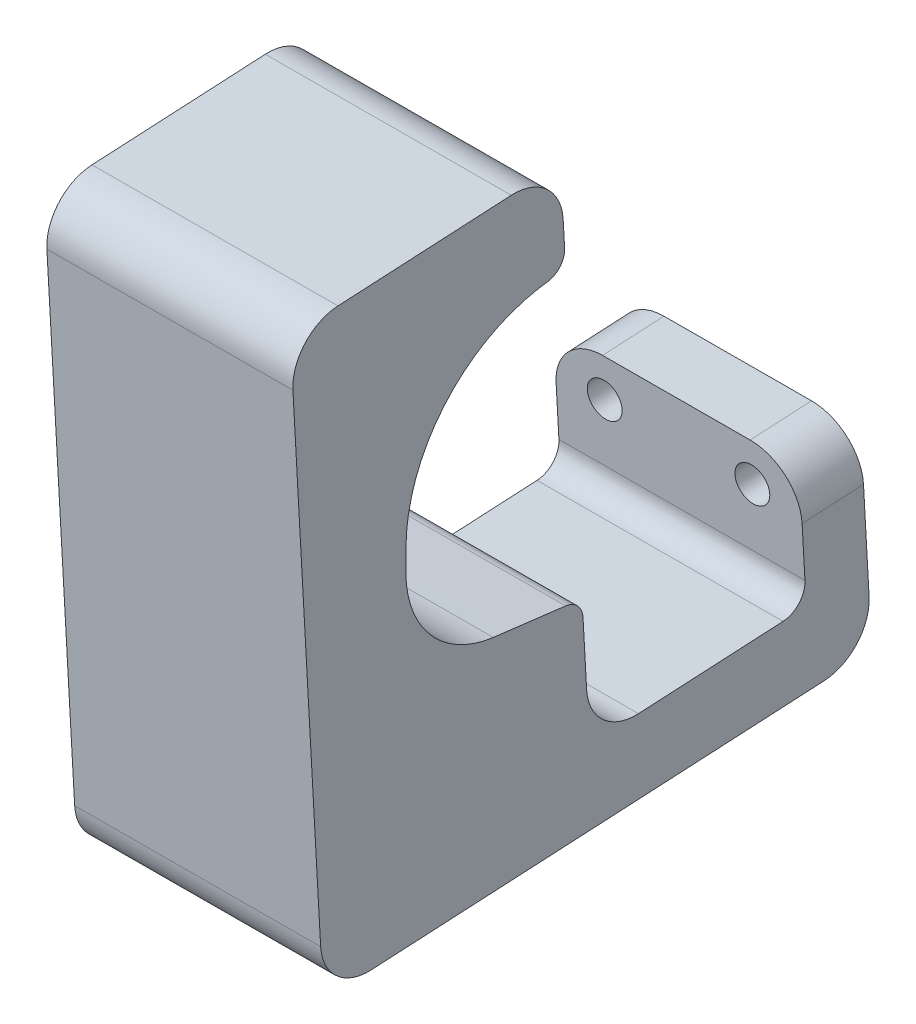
ISO-10303-21;
HEADER;
FILE_DESCRIPTION(('STEP AP214'),'2;1');
FILE_NAME('part.step','',(''),(''),'','','');
FILE_SCHEMA(('AUTOMOTIVE_DESIGN { 1 0 10303 214 1 1 1 1 }'));
ENDSEC;
DATA;
#1=APPLICATION_CONTEXT('core data for automotive mechanical design processes');
#2=APPLICATION_PROTOCOL_DEFINITION('international standard','automotive_design',2000,#1);
#3=PRODUCT_CONTEXT('',#1,'mechanical');
#4=PRODUCT('Part','Part','',(#3));
#5=PRODUCT_RELATED_PRODUCT_CATEGORY('part','',(#4));
#6=PRODUCT_DEFINITION_FORMATION('','',#4);
#7=PRODUCT_DEFINITION_CONTEXT('part definition',#1,'design');
#8=PRODUCT_DEFINITION('design','',#6,#7);
#9=PRODUCT_DEFINITION_SHAPE('','',#8);
#10=(LENGTH_UNIT() NAMED_UNIT(*) SI_UNIT(.MILLI.,.METRE.));
#11=(NAMED_UNIT(*) PLANE_ANGLE_UNIT() SI_UNIT($,.RADIAN.));
#12=(NAMED_UNIT(*) SI_UNIT($,.STERADIAN.) SOLID_ANGLE_UNIT());
#13=UNCERTAINTY_MEASURE_WITH_UNIT(LENGTH_MEASURE(1.E-05),#10,'distance_accuracy_value','');
#14=(GEOMETRIC_REPRESENTATION_CONTEXT(3) GLOBAL_UNCERTAINTY_ASSIGNED_CONTEXT((#13)) GLOBAL_UNIT_ASSIGNED_CONTEXT((#10,
#11,#12)) REPRESENTATION_CONTEXT('',''));
#15=CARTESIAN_POINT('',(0.,0.,0.));
#16=DIRECTION('',(0.,0.,1.));
#17=DIRECTION('',(1.,0.,0.));
#18=AXIS2_PLACEMENT_3D('',#15,#16,#17);
#19=CARTESIAN_POINT('',(-812.344248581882,-579.787099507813,58.8685484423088));
#20=CARTESIAN_POINT('',(-812.344272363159,-579.780320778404,58.922988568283));
#21=CARTESIAN_POINT('',(-812.344296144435,-579.773542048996,58.9774286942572));
#22=CARTESIAN_POINT('',(-812.344366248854,-579.753559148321,59.1379118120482));
#23=CARTESIAN_POINT('',(-812.344459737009,-579.72691083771,59.3519226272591));
#24=CARTESIAN_POINT('',(-812.344676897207,-579.665160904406,59.7042057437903));
#25=CARTESIAN_POINT('',(-812.344910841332,-579.598681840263,60.041923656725));
#26=CARTESIAN_POINT('',(-812.345182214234,-579.521621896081,60.3806083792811));
#27=CARTESIAN_POINT('',(-812.345490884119,-579.434018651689,60.7199456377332));
#28=CARTESIAN_POINT('',(-812.345837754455,-579.33561710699,61.0595695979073));
#29=CARTESIAN_POINT('',(-812.346223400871,-579.226254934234,61.3991109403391));
#30=CARTESIAN_POINT('',(-812.346648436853,-579.105759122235,61.7381835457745));
#31=CARTESIAN_POINT('',(-812.347113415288,-578.973973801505,62.0763897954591));
#32=CARTESIAN_POINT('',(-812.347618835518,-578.830758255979,62.4133137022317));
#33=CARTESIAN_POINT('',(-812.348165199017,-578.675971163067,62.7485444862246));
#34=CARTESIAN_POINT('',(-812.349580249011,-578.275150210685,63.5506328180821));
#35=CARTESIAN_POINT('',(-812.352554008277,-577.433172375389,64.8931588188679));
#36=CARTESIAN_POINT('',(-812.358408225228,-575.776501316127,66.7008684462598));
#37=CARTESIAN_POINT('',(-812.365043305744,-573.899636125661,67.9982134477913));
#38=CARTESIAN_POINT('',(-812.370602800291,-572.327416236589,68.705658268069));
#39=CARTESIAN_POINT('',(-812.373933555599,-571.38558585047,69.0292625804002));
#40=CARTESIAN_POINT('',(-812.376578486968,-570.637740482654,69.2322424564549));
#41=CARTESIAN_POINT('',(-812.379157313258,-569.908636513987,69.38161789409));
#42=CARTESIAN_POINT('',(-812.381656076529,-569.202215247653,69.4813782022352));
#43=CARTESIAN_POINT('',(-812.384326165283,-568.447397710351,69.5505533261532));
#44=CARTESIAN_POINT('',(-812.385732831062,-568.049779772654,69.5506480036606));
#45=CARTESIAN_POINT('',(-812.386584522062,-567.809034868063,69.5507048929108));
#46=CARTESIAN_POINT('',(-812.386763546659,-567.758430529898,69.5507168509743));
#47=CARTESIAN_POINT('',(-812.386942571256,-567.707826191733,69.5507288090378));
#48=B_SPLINE_CURVE_WITH_KNOTS('',3,(#19,#20,#21,#22,#23,#24,#25,#26,#27,#28,#29,#30,#31,#32,#33,
#34,#35,#36,#37,#38,#39,#40,#41,#42,#43,#44,#45,#46,#47),.UNSPECIFIED.,.F.,.F.,(4,2,1,1,1,1,1,1,
1,1,1,1,1,1,1,1,1,1,1,1,1,1,1,2,4),(-0.01,0.,0.019478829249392,0.0391378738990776,
0.0589771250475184,0.0789965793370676,0.0991962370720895,0.119576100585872,0.140136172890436,
0.160876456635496,0.181796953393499,0.202897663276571,0.224178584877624,0.245639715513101,
0.357955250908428,0.496884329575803,0.667013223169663,0.748061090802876,0.794466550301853,
0.839105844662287,0.881978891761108,0.923085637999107,0.962426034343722,1.,1.01),.UNSPECIFIED.);
#49=DIRECTION('',(-0.999993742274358,-0.00353771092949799,3.67481384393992E-06));
#50=VECTOR('',#49,1.);
#51=SURFACE_OF_LINEAR_EXTRUSION('',#48,#50);
#52=OFFSET_SURFACE('',#51,0.79375,.F.);
#53=CARTESIAN_POINT('',(-844.091334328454,-580.666752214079,59.130029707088));
#54=CARTESIAN_POINT('',(-844.091353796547,-580.661202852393,59.1746758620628));
#55=CARTESIAN_POINT('',(-844.091373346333,-580.655630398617,59.21932218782));
#56=CARTESIAN_POINT('',(-844.091413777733,-580.644109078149,59.3085658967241));
#57=CARTESIAN_POINT('',(-844.091434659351,-580.638160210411,59.3531632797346));
#58=CARTESIAN_POINT('',(-844.091478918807,-580.625556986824,59.4422516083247));
#59=CARTESIAN_POINT('',(-844.091502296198,-580.618902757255,59.486742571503));
#60=CARTESIAN_POINT('',(-844.091551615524,-580.604869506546,59.5756087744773));
#61=CARTESIAN_POINT('',(-844.091577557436,-580.597490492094,59.6199840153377));
#62=CARTESIAN_POINT('',(-844.091631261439,-580.582218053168,59.7086434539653));
#63=CARTESIAN_POINT('',(-844.091659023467,-580.574324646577,59.7529276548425));
#64=CARTESIAN_POINT('',(-844.09171585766,-580.558167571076,59.8414289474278));
#65=CARTESIAN_POINT('',(-844.091744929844,-580.549903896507,59.8856460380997));
#66=CARTESIAN_POINT('',(-844.091804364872,-580.53301178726,59.9740161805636));
#67=CARTESIAN_POINT('',(-844.091834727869,-580.524383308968,60.0181692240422));
#68=CARTESIAN_POINT('',(-844.091896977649,-580.506695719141,60.1063886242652));
#69=CARTESIAN_POINT('',(-844.09192886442,-580.497636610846,60.1504549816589));
#70=CARTESIAN_POINT('',(-844.092027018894,-580.469754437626,60.2824913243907));
#71=CARTESIAN_POINT('',(-844.09209579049,-580.450223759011,60.3703132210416));
#72=CARTESIAN_POINT('',(-844.092239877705,-580.409313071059,60.5455262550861));
#73=CARTESIAN_POINT('',(-844.092315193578,-580.387932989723,60.632917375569));
#74=CARTESIAN_POINT('',(-844.09255088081,-580.32104041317,60.894384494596));
#75=CARTESIAN_POINT('',(-844.092720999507,-580.272773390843,61.0677646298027));
#76=CARTESIAN_POINT('',(-844.093086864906,-580.168997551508,61.412220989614));
#77=CARTESIAN_POINT('',(-844.093282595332,-580.113493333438,61.5832986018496));
#78=CARTESIAN_POINT('',(-844.093699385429,-579.995327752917,61.9229563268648));
#79=CARTESIAN_POINT('',(-844.093920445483,-579.93266628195,62.0915364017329));
#80=CARTESIAN_POINT('',(-844.094621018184,-579.734116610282,62.5930666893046));
#81=CARTESIAN_POINT('',(-844.095138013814,-579.587637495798,62.921892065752));
#82=CARTESIAN_POINT('',(-844.096268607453,-579.267386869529,63.5661647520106));
#83=CARTESIAN_POINT('',(-844.096882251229,-579.093602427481,63.8816056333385));
#84=CARTESIAN_POINT('',(-844.09787132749,-578.813544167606,64.3428808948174));
#85=CARTESIAN_POINT('',(-844.098212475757,-578.716955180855,64.4946664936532));
#86=CARTESIAN_POINT('',(-844.09891715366,-578.517455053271,64.7940809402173));
#87=CARTESIAN_POINT('',(-844.099280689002,-578.414542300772,64.9417087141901));
#88=CARTESIAN_POINT('',(-844.100403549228,-578.096693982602,65.3777243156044));
#89=CARTESIAN_POINT('',(-844.101195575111,-577.872521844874,65.6594528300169));
#90=CARTESIAN_POINT('',(-844.102860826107,-577.401245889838,66.2030262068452));
#91=CARTESIAN_POINT('',(-844.103734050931,-577.15414215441,66.4648711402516));
#92=CARTESIAN_POINT('',(-844.105099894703,-576.767672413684,66.8412190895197));
#93=CARTESIAN_POINT('',(-844.105564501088,-576.636216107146,66.9639296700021));
#94=CARTESIAN_POINT('',(-844.106511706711,-576.368223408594,67.2036721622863));
#95=CARTESIAN_POINT('',(-844.106994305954,-576.231687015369,67.3207040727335));
#96=CARTESIAN_POINT('',(-844.108467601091,-575.814879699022,67.6630043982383));
#97=CARTESIAN_POINT('',(-844.109483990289,-575.527355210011,67.8795313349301));
#98=CARTESIAN_POINT('',(-844.111578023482,-574.935017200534,68.2878714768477));
#99=CARTESIAN_POINT('',(-844.112655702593,-574.630193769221,68.4796703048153));
#100=CARTESIAN_POINT('',(-844.114312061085,-574.161717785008,68.7475732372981));
#101=CARTESIAN_POINT('',(-844.114870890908,-574.003665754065,68.8335842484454));
#102=CARTESIAN_POINT('',(-844.11600096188,-573.684060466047,68.9988248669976));
#103=CARTESIAN_POINT('',(-844.116572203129,-573.522507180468,69.0780544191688));
#104=CARTESIAN_POINT('',(-844.118303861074,-573.032788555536,69.3055039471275));
#105=CARTESIAN_POINT('',(-844.119481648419,-572.699723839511,69.44339368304));
#106=CARTESIAN_POINT('',(-844.121275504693,-572.192467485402,69.6287940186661));
#107=CARTESIAN_POINT('',(-844.121878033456,-572.022092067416,69.6870254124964));
#108=CARTESIAN_POINT('',(-844.123091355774,-571.679012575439,69.7962422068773));
#109=CARTESIAN_POINT('',(-844.123702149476,-571.506308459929,69.8472274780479));
#110=CARTESIAN_POINT('',(-844.124929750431,-571.15920808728,69.9417948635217));
#111=CARTESIAN_POINT('',(-844.125546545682,-570.984815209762,69.985389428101));
#112=CARTESIAN_POINT('',(-844.126786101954,-570.634350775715,70.0652171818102));
#113=CARTESIAN_POINT('',(-844.12740886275,-570.45827928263,70.1014506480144));
#114=CARTESIAN_POINT('',(-844.128346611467,-570.193158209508,70.1501268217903));
#115=CARTESIAN_POINT('',(-844.128659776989,-570.104620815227,70.1654058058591));
#116=CARTESIAN_POINT('',(-844.129287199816,-569.927239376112,70.1940764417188));
#117=CARTESIAN_POINT('',(-844.129601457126,-569.838395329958,70.2074680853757));
#118=CARTESIAN_POINT('',(-844.130230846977,-569.660461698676,70.2324608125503));
#119=CARTESIAN_POINT('',(-844.130545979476,-569.571372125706,70.244061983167));
#120=CARTESIAN_POINT('',(-844.13117691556,-569.39300490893,70.265701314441));
#121=CARTESIAN_POINT('',(-844.131492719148,-569.303727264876,70.2757394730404));
#122=CARTESIAN_POINT('',(-844.132174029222,-569.111122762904,70.2956713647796));
#123=CARTESIAN_POINT('',(-844.132539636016,-569.007767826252,70.3053004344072));
#124=CARTESIAN_POINT('',(-844.133088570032,-568.852589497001,70.3176804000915));
#125=CARTESIAN_POINT('',(-844.133271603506,-568.800848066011,70.3214626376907));
#126=CARTESIAN_POINT('',(-844.133637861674,-568.697312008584,70.3282025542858));
#127=CARTESIAN_POINT('',(-844.133821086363,-568.645517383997,70.3311602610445));
#128=CARTESIAN_POINT('',(-844.134187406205,-568.541965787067,70.3360772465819));
#129=CARTESIAN_POINT('',(-844.134370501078,-568.490208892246,70.3380381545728));
#130=CARTESIAN_POINT('',(-844.134736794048,-568.386666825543,70.3410931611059));
#131=CARTESIAN_POINT('',(-844.13491999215,-568.334881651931,70.3421871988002));
#132=CARTESIAN_POINT('',(-844.135286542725,-568.231268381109,70.3436899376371));
#133=CARTESIAN_POINT('',(-844.135469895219,-568.179440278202,70.3440981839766));
#134=CARTESIAN_POINT('',(-844.135836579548,-568.075790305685,70.3445359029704));
#135=CARTESIAN_POINT('',(-844.136019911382,-568.023968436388,70.3445654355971));
#136=CARTESIAN_POINT('',(-844.136203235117,-567.972148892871,70.3445595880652));
#137=B_SPLINE_CURVE_WITH_KNOTS('',3,(#53,#54,#55,#56,#57,#58,#59,#60,#61,#62,#63,#64,#65,#66,
#67,#68,#69,#70,#71,#72,#73,#74,#75,#76,#77,#78,#79,#80,#81,#82,#83,#84,#85,#86,#87,#88,#89,#90,
#91,#92,#93,#94,#95,#96,#97,#98,#99,#100,#101,#102,#103,#104,#105,#106,#107,#108,#109,#110,#111,
#112,#113,#114,#115,#116,#117,#118,#119,#120,#121,#122,#123,#124,#125,#126,#127,#128,#129,#130,
#131,#132,#133,#134,#135,#136),.UNSPECIFIED.,.F.,.F.,(4,2,2,2,2,2,2,2,2,2,2,2,2,2,2,2,2,2,2,2,2,
2,2,2,2,2,2,2,2,2,2,2,2,2,2,2,2,2,2,2,2,4),(0.,0.134974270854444,0.269948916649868,
0.404899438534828,0.539848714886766,0.674793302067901,0.809739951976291,0.94470278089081,
1.07966459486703,1.34954353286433,1.61943298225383,2.15918008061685,2.6985858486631,
3.23799979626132,4.31656189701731,5.39563629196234,5.93523408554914,6.47496997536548,
7.55371273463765,8.6324516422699,9.17180073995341,9.71114996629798,10.7896171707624,
11.8687086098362,12.4083855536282,12.9480668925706,14.0279786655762,14.568017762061,
15.1080664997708,15.6471962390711,16.1863056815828,16.4558285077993,16.7253524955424,
16.9948633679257,17.264374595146,17.5757519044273,17.7313865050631,17.8870158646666,
18.0423900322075,18.197775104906,18.3532631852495,18.5087266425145),.UNSPECIFIED.);
#138=CARTESIAN_POINT('',(-844.091334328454,-580.666752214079,59.130029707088));
#139=VERTEX_POINT('',#138);
#140=CARTESIAN_POINT('',(-844.136203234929,-567.972148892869,70.3445595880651));
#141=VERTEX_POINT('',#140);
#142=EDGE_CURVE('E238',#139,#141,#137,.T.);
#143=ORIENTED_EDGE('',*,*,#142,.T.);
#144=DIRECTION('',(-0.999993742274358,-0.00353771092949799,3.67481384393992E-06));
#145=VECTOR('',#144,1.);
#146=CARTESIAN_POINT('',(-812.386401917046,-567.859826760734,70.3444429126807));
#147=LINE('',#146,#145);
#148=CARTESIAN_POINT('',(-812.386401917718,-567.859826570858,70.3444429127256));
#149=VERTEX_POINT('',#148);
#150=EDGE_CURVE('E402',#149,#141,#147,.T.);
#151=ORIENTED_EDGE('',*,*,#150,.F.);
#152=CARTESIAN_POINT('',(-812.341533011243,-580.554429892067,59.1299130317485));
#153=CARTESIAN_POINT('',(-812.341552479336,-580.548880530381,59.1745591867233));
#154=CARTESIAN_POINT('',(-812.341572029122,-580.543308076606,59.2192055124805));
#155=CARTESIAN_POINT('',(-812.341612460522,-580.531786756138,59.3084492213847));
#156=CARTESIAN_POINT('',(-812.34163334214,-580.5258378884,59.3530466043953));
#157=CARTESIAN_POINT('',(-812.341677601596,-580.513234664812,59.4421349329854));
#158=CARTESIAN_POINT('',(-812.341700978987,-580.506580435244,59.4866258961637));
#159=CARTESIAN_POINT('',(-812.341750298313,-580.492547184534,59.5754920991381));
#160=CARTESIAN_POINT('',(-812.341776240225,-580.485168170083,59.6198673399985));
#161=CARTESIAN_POINT('',(-812.341829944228,-580.469895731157,59.7085267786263));
#162=CARTESIAN_POINT('',(-812.341857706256,-580.462002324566,59.7528109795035));
#163=CARTESIAN_POINT('',(-812.341914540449,-580.445845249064,59.8413122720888));
#164=CARTESIAN_POINT('',(-812.341943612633,-580.437581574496,59.8855293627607));
#165=CARTESIAN_POINT('',(-812.342003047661,-580.420689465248,59.9738995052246));
#166=CARTESIAN_POINT('',(-812.342033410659,-580.412060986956,60.0180525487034));
#167=CARTESIAN_POINT('',(-812.342095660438,-580.39437339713,60.1062719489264));
#168=CARTESIAN_POINT('',(-812.342127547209,-580.385314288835,60.1503383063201));
#169=CARTESIAN_POINT('',(-812.342225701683,-580.357432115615,60.282374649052));
#170=CARTESIAN_POINT('',(-812.34229447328,-580.337901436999,60.370196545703));
#171=CARTESIAN_POINT('',(-812.342438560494,-580.296990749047,60.5454095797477));
#172=CARTESIAN_POINT('',(-812.342513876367,-580.275610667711,60.6328007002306));
#173=CARTESIAN_POINT('',(-812.342749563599,-580.208718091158,60.8942678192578));
#174=CARTESIAN_POINT('',(-812.342919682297,-580.160451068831,61.0676479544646));
#175=CARTESIAN_POINT('',(-812.343285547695,-580.056675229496,61.4121043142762));
#176=CARTESIAN_POINT('',(-812.343481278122,-580.001171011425,61.5831819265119));
#177=CARTESIAN_POINT('',(-812.343898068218,-579.883005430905,61.9228396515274));
#178=CARTESIAN_POINT('',(-812.344119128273,-579.820343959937,62.0914197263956));
#179=CARTESIAN_POINT('',(-812.344819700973,-579.62179428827,62.5929500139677));
#180=CARTESIAN_POINT('',(-812.345336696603,-579.475315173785,62.9217753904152));
#181=CARTESIAN_POINT('',(-812.346467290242,-579.155064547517,63.5660480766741));
#182=CARTESIAN_POINT('',(-812.347080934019,-578.981280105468,63.881488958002));
#183=CARTESIAN_POINT('',(-812.348070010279,-578.701221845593,64.3427642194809));
#184=CARTESIAN_POINT('',(-812.348411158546,-578.604632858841,64.4945498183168));
#185=CARTESIAN_POINT('',(-812.349115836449,-578.405132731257,64.7939642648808));
#186=CARTESIAN_POINT('',(-812.349479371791,-578.302219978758,64.9415920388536));
#187=CARTESIAN_POINT('',(-812.350602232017,-577.984371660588,65.3776076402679));
#188=CARTESIAN_POINT('',(-812.3513942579,-577.76019952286,65.6593361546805));
#189=CARTESIAN_POINT('',(-812.353059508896,-577.288923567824,66.2029095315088));
#190=CARTESIAN_POINT('',(-812.35393273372,-577.041819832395,66.4647544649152));
#191=CARTESIAN_POINT('',(-812.355298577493,-576.655350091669,66.8411024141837));
#192=CARTESIAN_POINT('',(-812.355763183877,-576.52389378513,66.9638129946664));
#193=CARTESIAN_POINT('',(-812.3567103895,-576.255901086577,67.2035554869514));
#194=CARTESIAN_POINT('',(-812.357192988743,-576.119364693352,67.3205873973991));
#195=CARTESIAN_POINT('',(-812.35866628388,-575.702557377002,67.6628877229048));
#196=CARTESIAN_POINT('',(-812.359682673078,-575.41503288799,67.8794146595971));
#197=CARTESIAN_POINT('',(-812.361776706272,-574.822694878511,68.2877548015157));
#198=CARTESIAN_POINT('',(-812.362854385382,-574.517871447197,68.4795536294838));
#199=CARTESIAN_POINT('',(-812.364510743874,-574.049395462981,68.7474565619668));
#200=CARTESIAN_POINT('',(-812.365069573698,-573.891343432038,68.8334675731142));
#201=CARTESIAN_POINT('',(-812.366199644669,-573.571738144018,68.9987081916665));
#202=CARTESIAN_POINT('',(-812.366770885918,-573.410184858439,69.0779377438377));
#203=CARTESIAN_POINT('',(-812.368502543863,-572.920466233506,69.305387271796));
#204=CARTESIAN_POINT('',(-812.369680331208,-572.587401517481,69.4432770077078));
#205=CARTESIAN_POINT('',(-812.371474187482,-572.080145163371,69.6286773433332));
#206=CARTESIAN_POINT('',(-812.372076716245,-571.909769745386,69.6869087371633));
#207=CARTESIAN_POINT('',(-812.373290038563,-571.566690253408,69.7961255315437));
#208=CARTESIAN_POINT('',(-812.373900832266,-571.393986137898,69.8471108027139));
#209=CARTESIAN_POINT('',(-812.37512843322,-571.046885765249,69.9416781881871));
#210=CARTESIAN_POINT('',(-812.375745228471,-570.872492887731,69.9852727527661));
#211=CARTESIAN_POINT('',(-812.376984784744,-570.522028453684,70.0651005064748));
#212=CARTESIAN_POINT('',(-812.377607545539,-570.345956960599,70.1013339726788));
#213=CARTESIAN_POINT('',(-812.378545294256,-570.080835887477,70.1500101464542));
#214=CARTESIAN_POINT('',(-812.378858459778,-569.992298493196,70.165289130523));
#215=CARTESIAN_POINT('',(-812.379485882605,-569.81491705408,70.1939597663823));
#216=CARTESIAN_POINT('',(-812.379800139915,-569.726073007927,70.2073514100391));
#217=CARTESIAN_POINT('',(-812.380429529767,-569.548139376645,70.2323441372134));
#218=CARTESIAN_POINT('',(-812.380744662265,-569.459049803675,70.24394530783));
#219=CARTESIAN_POINT('',(-812.38137559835,-569.280682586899,70.2655846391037));
#220=CARTESIAN_POINT('',(-812.381691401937,-569.191404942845,70.275622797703));
#221=CARTESIAN_POINT('',(-812.382372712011,-568.998800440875,70.2955546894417));
#222=CARTESIAN_POINT('',(-812.382738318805,-568.895445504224,70.3051837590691));
#223=CARTESIAN_POINT('',(-812.383287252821,-568.740267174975,70.317563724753));
#224=CARTESIAN_POINT('',(-812.383470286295,-568.688525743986,70.3213459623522));
#225=CARTESIAN_POINT('',(-812.383836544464,-568.584989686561,70.328085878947));
#226=CARTESIAN_POINT('',(-812.384019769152,-568.533195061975,70.3310435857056));
#227=CARTESIAN_POINT('',(-812.384386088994,-568.429643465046,70.3359605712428));
#228=CARTESIAN_POINT('',(-812.384569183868,-568.377886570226,70.3379214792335));
#229=CARTESIAN_POINT('',(-812.384935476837,-568.274344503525,70.3409764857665));
#230=CARTESIAN_POINT('',(-812.385118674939,-568.222559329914,70.3420705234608));
#231=CARTESIAN_POINT('',(-812.385485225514,-568.118946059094,70.3435732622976));
#232=CARTESIAN_POINT('',(-812.385668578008,-568.067117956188,70.3439815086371));
#233=CARTESIAN_POINT('',(-812.386035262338,-567.963467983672,70.3444192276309));
#234=CARTESIAN_POINT('',(-812.386218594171,-567.911646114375,70.3444487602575));
#235=CARTESIAN_POINT('',(-812.386401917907,-567.85982657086,70.3444429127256));
#236=B_SPLINE_CURVE_WITH_KNOTS('',3,(#152,#153,#154,#155,#156,#157,#158,#159,#160,#161,#162,
#163,#164,#165,#166,#167,#168,#169,#170,#171,#172,#173,#174,#175,#176,#177,#178,#179,#180,#181,
#182,#183,#184,#185,#186,#187,#188,#189,#190,#191,#192,#193,#194,#195,#196,#197,#198,#199,#200,
#201,#202,#203,#204,#205,#206,#207,#208,#209,#210,#211,#212,#213,#214,#215,#216,#217,#218,#219,
#220,#221,#222,#223,#224,#225,#226,#227,#228,#229,#230,#231,#232,#233,#234,#235),.UNSPECIFIED.,
.F.,.F.,(4,2,2,2,2,2,2,2,2,2,2,2,2,2,2,2,2,2,2,2,2,2,2,2,2,2,2,2,2,2,2,2,2,2,2,2,2,2,2,2,2,4),
(0.,0.134974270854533,0.269948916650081,0.404899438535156,0.539848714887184,0.674793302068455,
0.809739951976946,0.944702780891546,1.07966459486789,1.3495435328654,1.6194329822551,
2.15918008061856,2.69858584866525,3.23799979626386,4.3165618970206,5.39563629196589,
5.93523408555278,6.4749699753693,7.55371273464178,8.63245164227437,9.17180073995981,
9.71114996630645,10.7896171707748,11.8687086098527,12.4083855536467,12.9480668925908,
14.0279786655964,14.5680177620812,15.1080664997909,15.6471962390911,16.1863056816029,
16.4558285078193,16.7253524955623,16.9948633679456,17.2643745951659,17.5757519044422,
17.7313865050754,17.8870158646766,18.0423900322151,18.1977751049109,18.3532631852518,
18.5087266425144),.UNSPECIFIED.);
#237=CARTESIAN_POINT('',(-812.341533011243,-580.554429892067,59.1299130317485));
#238=VERTEX_POINT('',#237);
#239=EDGE_CURVE('E381',#238,#149,#236,.T.);
#240=ORIENTED_EDGE('',*,*,#239,.F.);
#241=CARTESIAN_POINT('',(-812.341533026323,-580.554425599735,59.1299475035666));
#242=CARTESIAN_POINT('',(-813.66444141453,-580.559105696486,59.129952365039));
#243=CARTESIAN_POINT('',(-814.987349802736,-580.563785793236,59.1299572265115));
#244=CARTESIAN_POINT('',(-817.633166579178,-580.573145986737,59.1299669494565));
#245=CARTESIAN_POINT('',(-818.956074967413,-580.577826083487,59.129971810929));
#246=CARTESIAN_POINT('',(-821.601891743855,-580.587186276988,59.1299815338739));
#247=CARTESIAN_POINT('',(-822.924800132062,-580.591866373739,59.1299863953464));
#248=CARTESIAN_POINT('',(-825.570616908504,-580.60122656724,59.1299961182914));
#249=CARTESIAN_POINT('',(-826.893525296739,-580.60590666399,59.1300009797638));
#250=CARTESIAN_POINT('',(-829.539342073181,-580.615266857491,59.1300107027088));
#251=CARTESIAN_POINT('',(-830.862250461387,-580.619946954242,59.1300155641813));
#252=CARTESIAN_POINT('',(-833.508067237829,-580.629307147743,59.1300252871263));
#253=CARTESIAN_POINT('',(-834.830975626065,-580.633987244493,59.1300301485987));
#254=CARTESIAN_POINT('',(-837.476792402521,-580.643347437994,59.1300398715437));
#255=CARTESIAN_POINT('',(-838.799700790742,-580.648027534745,59.1300447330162));
#256=CARTESIAN_POINT('',(-841.44551756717,-580.657387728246,59.1300544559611));
#257=CARTESIAN_POINT('',(-842.768425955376,-580.662067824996,59.1300593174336));
#258=CARTESIAN_POINT('',(-844.091334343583,-580.666747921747,59.1300641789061));
#259=B_SPLINE_CURVE_WITH_KNOTS('',3,(#241,#242,#243,#244,#245,#246,#247,#248,#249,#250,#251,
#252,#253,#254,#255,#256,#257,#258),.UNSPECIFIED.,.F.,.F.,(4,2,2,2,2,2,2,2,4),(0.,
3.96874999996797,7.93750000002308,11.9062499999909,15.8750000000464,19.843750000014,
23.8125000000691,27.7812500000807,31.7500000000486),.UNSPECIFIED.);
#260=EDGE_CURVE('E413',#238,#139,#259,.T.);
#261=ORIENTED_EDGE('',*,*,#260,.T.);
#262=EDGE_LOOP('',(#143,#151,#240,#261));
#263=FACE_BOUND('',#262,.T.);
#264=ADVANCED_FACE('F63',(#263),#52,.F.);
#265=CARTESIAN_POINT('',(-812.396178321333,-565.09636029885,70.3450952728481));
#266=DIRECTION('',(4.50991837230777E-06,-0.000236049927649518,0.999999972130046));
#267=DIRECTION('',(0.,-0.999999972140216,-0.000236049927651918));
#268=AXIS2_PLACEMENT_3D('',#265,#266,#267);
#269=PLANE('',#268);
#270=DIRECTION('',(-0.00353770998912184,0.999993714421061,0.000236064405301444));
#271=VECTOR('',#270,1.);
#272=CARTESIAN_POINT('',(-844.1459796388,-565.208682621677,70.3452119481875));
#273=LINE('',#272,#271);
#274=CARTESIAN_POINT('',(-844.145979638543,-565.208682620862,70.3452119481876));
#275=VERTEX_POINT('',#274);
#276=EDGE_CURVE('E362',#141,#275,#273,.T.);
#277=ORIENTED_EDGE('',*,*,#276,.T.);
#278=DIRECTION('',(-0.999993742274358,-0.00353771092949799,3.67481384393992E-06));
#279=VECTOR('',#278,1.);
#280=CARTESIAN_POINT('',(-812.39617833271,-565.096357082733,70.3450952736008));
#281=LINE('',#280,#279);
#282=CARTESIAN_POINT('',(-812.396178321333,-565.09636029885,70.3450952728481));
#283=VERTEX_POINT('',#282);
#284=EDGE_CURVE('E564',#283,#275,#281,.T.);
#285=ORIENTED_EDGE('',*,*,#284,.F.);
#286=DIRECTION('',(-0.00353770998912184,0.999993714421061,0.000236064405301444));
#287=VECTOR('',#286,1.);
#288=CARTESIAN_POINT('',(-812.396178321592,-565.096360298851,70.3450952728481));
#289=LINE('',#288,#287);
#290=EDGE_CURVE('E380',#149,#283,#289,.T.);
#291=ORIENTED_EDGE('',*,*,#290,.F.);
#292=ORIENTED_EDGE('',*,*,#150,.T.);
#293=EDGE_LOOP('',(#277,#285,#291,#292));
#294=FACE_BOUND('',#293,.T.);
#295=ADVANCED_FACE('F312',(#294),#269,.F.);
#296=CARTESIAN_POINT('',(-812.395111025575,-565.398874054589,69.551275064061));
#297=CARTESIAN_POINT('',(-812.395467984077,-565.297973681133,69.551298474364));
#298=CARTESIAN_POINT('',(-812.395824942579,-565.197073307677,69.5513218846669));
#299=CARTESIAN_POINT('',(-812.396710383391,-564.946788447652,69.5513799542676));
#300=CARTESIAN_POINT('',(-812.397765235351,-564.648620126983,69.5481056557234));
#301=CARTESIAN_POINT('',(-812.399238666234,-564.232144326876,69.5343165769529));
#302=CARTESIAN_POINT('',(-812.400761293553,-563.801771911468,69.5112968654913));
#303=CARTESIAN_POINT('',(-812.402278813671,-563.372852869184,69.4789038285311));
#304=CARTESIAN_POINT('',(-812.403790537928,-562.945581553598,69.437434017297));
#305=CARTESIAN_POINT('',(-812.405295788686,-562.520149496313,69.3869007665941));
#306=CARTESIAN_POINT('',(-812.40679389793,-562.096745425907,69.3273980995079));
#307=CARTESIAN_POINT('',(-812.408284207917,-561.675555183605,69.2590033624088));
#308=CARTESIAN_POINT('',(-812.409766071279,-561.256761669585,69.181803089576));
#309=CARTESIAN_POINT('',(-812.411238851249,-560.840544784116,69.0958859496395));
#310=CARTESIAN_POINT('',(-812.412701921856,-560.427081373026,69.0013444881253));
#311=CARTESIAN_POINT('',(-812.414154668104,-560.016545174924,68.8982745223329));
#312=CARTESIAN_POINT('',(-812.415596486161,-559.609106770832,68.786775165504));
#313=CARTESIAN_POINT('',(-812.417026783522,-559.204933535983,68.6669486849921));
#314=CARTESIAN_POINT('',(-812.418444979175,-558.804189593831,68.5389004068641));
#315=CARTESIAN_POINT('',(-812.419850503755,-558.4070357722,68.4027386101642));
#316=CARTESIAN_POINT('',(-812.421242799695,-558.013629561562,68.2585744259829));
#317=CARTESIAN_POINT('',(-812.422621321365,-557.62412507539,68.1065217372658));
#318=CARTESIAN_POINT('',(-812.423985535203,-557.238673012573,67.946697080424));
#319=CARTESIAN_POINT('',(-812.425334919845,-556.857420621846,67.7792195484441));
#320=CARTESIAN_POINT('',(-812.426668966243,-556.480511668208,67.604210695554));
#321=CARTESIAN_POINT('',(-812.427987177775,-556.108086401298,67.4217944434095));
#322=CARTESIAN_POINT('',(-812.429289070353,-555.740281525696,67.2320969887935));
#323=CARTESIAN_POINT('',(-812.430574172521,-555.377230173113,67.0352467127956));
#324=CARTESIAN_POINT('',(-812.431842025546,-555.019061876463,66.8313740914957));
#325=CARTESIAN_POINT('',(-812.433092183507,-554.665902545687,66.6206116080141));
#326=CARTESIAN_POINT('',(-812.434324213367,-554.317874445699,66.4030936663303));
#327=CARTESIAN_POINT('',(-812.435537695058,-553.975096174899,66.1789565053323));
#328=CARTESIAN_POINT('',(-812.436732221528,-553.637682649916,65.9483381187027));
#329=CARTESIAN_POINT('',(-812.437907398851,-553.305745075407,65.7113781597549));
#330=CARTESIAN_POINT('',(-812.439062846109,-552.979390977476,65.468217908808));
#331=CARTESIAN_POINT('',(-812.440198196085,-552.658724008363,65.2190000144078));
#332=CARTESIAN_POINT('',(-812.44131309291,-552.343844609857,64.963869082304));
#333=CARTESIAN_POINT('',(-812.442407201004,-552.034847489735,64.7029691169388));
#334=CARTESIAN_POINT('',(-812.443843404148,-551.629250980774,64.3462290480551));
#335=CARTESIAN_POINT('',(-812.445597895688,-551.13379549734,63.8829995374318));
#336=CARTESIAN_POINT('',(-812.447632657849,-550.55924105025,63.3001450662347));
#337=CARTESIAN_POINT('',(-812.44959481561,-550.005237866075,62.6899475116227));
#338=CARTESIAN_POINT('',(-812.451479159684,-549.473257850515,62.0529718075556));
#339=CARTESIAN_POINT('',(-812.45328052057,-548.96476158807,61.3898556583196));
#340=CARTESIAN_POINT('',(-812.454993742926,-548.481205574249,60.7013201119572));
#341=CARTESIAN_POINT('',(-812.456613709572,-548.024035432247,59.9881681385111));
#342=CARTESIAN_POINT('',(-812.458135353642,-547.594682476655,59.2512862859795));
#343=CARTESIAN_POINT('',(-812.459553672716,-547.194559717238,58.4916452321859));
#344=CARTESIAN_POINT('',(-812.460863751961,-546.825055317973,57.7103006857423));
#345=CARTESIAN_POINT('',(-812.462060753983,-546.487535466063,56.9083929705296));
#346=CARTESIAN_POINT('',(-812.463140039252,-546.183310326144,56.0871504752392));
#347=CARTESIAN_POINT('',(-812.464096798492,-545.913737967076,55.247877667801));
#348=CARTESIAN_POINT('',(-812.464927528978,-545.679807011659,54.3920002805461));
#349=CARTESIAN_POINT('',(-812.465624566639,-545.483682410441,53.5208940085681));
#350=CARTESIAN_POINT('',(-812.466165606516,-545.331616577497,52.6850605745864));
#351=CARTESIAN_POINT('',(-812.466466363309,-545.247254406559,52.0575629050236));
#352=CARTESIAN_POINT('',(-812.466590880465,-545.212386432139,51.7409312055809));
#353=B_SPLINE_CURVE_WITH_KNOTS('',3,(#296,#297,#298,#299,#300,#301,#302,#303,#304,#305,#306,
#307,#308,#309,#310,#311,#312,#313,#314,#315,#316,#317,#318,#319,#320,#321,#322,#323,#324,#325,
#326,#327,#328,#329,#330,#331,#332,#333,#334,#335,#336,#337,#338,#339,#340,#341,#342,#343,#344,
#345,#346,#347,#348,#349,#350,#351,#352),.UNSPECIFIED.,.F.,.F.,(4,2,1,1,1,1,1,1,1,1,1,1,1,1,1,1,
1,1,1,1,1,1,1,1,1,1,1,1,1,1,1,1,1,1,1,1,1,1,1,1,1,1,1,1,1,1,1,1,1,1,1,1,1,4),(-0.01,0.,
0.0148051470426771,0.0295809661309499,0.0443274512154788,0.0590445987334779,0.0737324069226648,
0.088390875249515,0.103020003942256,0.117619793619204,0.132190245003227,0.146731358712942,
0.161243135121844,0.175725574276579,0.190178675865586,0.204602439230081,0.218996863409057,
0.233361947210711,0.247697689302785,0.262004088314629,0.276281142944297,0.290528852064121,
0.304747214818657,0.318936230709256,0.333095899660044,0.34722622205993,0.361327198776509,
0.375398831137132,0.389441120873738,0.403454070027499,0.417437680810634,0.431391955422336,
0.445316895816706,0.459212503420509,0.473078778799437,0.486915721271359,0.500723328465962,
0.528524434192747,0.556521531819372,0.584714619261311,0.61310370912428,0.641688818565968,
0.670469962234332,0.699447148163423,0.728620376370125,0.757989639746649,0.78755492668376,
0.817316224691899,0.847273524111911,0.87742682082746,0.907776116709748,0.938321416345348,
0.969062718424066,1.),.UNSPECIFIED.);
#354=DIRECTION('',(-0.999993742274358,-0.00353771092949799,3.67481384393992E-06));
#355=VECTOR('',#354,1.);
#356=SURFACE_OF_LINEAR_EXTRUSION('',#353,#355);
#357=OFFSET_SURFACE('',#356,0.79375,.F.);
#358=CARTESIAN_POINT('',(-844.145979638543,-565.208682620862,70.3452119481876));
#359=CARTESIAN_POINT('',(-844.14632446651,-565.111211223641,70.3452086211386));
#360=CARTESIAN_POINT('',(-844.146669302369,-565.013738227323,70.3445701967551));
#361=CARTESIAN_POINT('',(-844.147358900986,-564.818814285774,70.3419335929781));
#362=CARTESIAN_POINT('',(-844.147703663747,-564.721363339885,70.3399354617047));
#363=CARTESIAN_POINT('',(-844.148393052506,-564.526501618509,70.3344898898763));
#364=CARTESIAN_POINT('',(-844.148737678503,-564.429090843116,70.3310424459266));
#365=CARTESIAN_POINT('',(-844.149426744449,-564.234323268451,70.3228113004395));
#366=CARTESIAN_POINT('',(-844.149771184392,-564.136966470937,70.3180275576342));
#367=CARTESIAN_POINT('',(-844.150459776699,-563.942335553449,70.3071235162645));
#368=CARTESIAN_POINT('',(-844.150803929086,-563.845061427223,70.3010033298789));
#369=CARTESIAN_POINT('',(-844.151491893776,-563.65061075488,70.2873669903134));
#370=CARTESIAN_POINT('',(-844.151835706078,-563.553434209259,70.2798508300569));
#371=CARTESIAN_POINT('',(-844.152866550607,-563.262074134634,70.2552645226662));
#372=CARTESIAN_POINT('',(-844.15355298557,-563.068061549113,70.2361566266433));
#373=CARTESIAN_POINT('',(-844.155608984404,-562.486966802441,70.1706521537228));
#374=CARTESIAN_POINT('',(-844.156975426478,-562.100775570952,70.1160718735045));
#375=CARTESIAN_POINT('',(-844.159694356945,-561.332359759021,69.9853396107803));
#376=CARTESIAN_POINT('',(-844.161046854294,-560.950132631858,69.9092024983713));
#377=CARTESIAN_POINT('',(-844.163734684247,-560.190552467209,69.7355710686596));
#378=CARTESIAN_POINT('',(-844.165070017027,-559.813199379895,69.6380769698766));
#379=CARTESIAN_POINT('',(-844.167719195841,-559.064588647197,69.4220538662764));
#380=CARTESIAN_POINT('',(-844.169033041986,-558.693330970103,69.3035249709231));
#381=CARTESIAN_POINT('',(-844.1722865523,-557.774006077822,68.9812744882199));
#382=CARTESIAN_POINT('',(-844.174210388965,-557.230426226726,68.7646021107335));
#383=CARTESIAN_POINT('',(-844.177987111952,-556.163368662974,68.2861782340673));
#384=CARTESIAN_POINT('',(-844.179839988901,-555.639893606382,68.0244208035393));
#385=CARTESIAN_POINT('',(-844.182555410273,-554.872775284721,67.5995044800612));
#386=CARTESIAN_POINT('',(-844.183449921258,-554.620079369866,67.4524819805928));
#387=CARTESIAN_POINT('',(-844.185216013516,-554.121179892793,67.1479606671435));
#388=CARTESIAN_POINT('',(-844.186087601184,-553.874974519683,66.9904648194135));
#389=CARTESIAN_POINT('',(-844.188666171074,-553.146604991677,66.5025781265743));
#390=CARTESIAN_POINT('',(-844.190337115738,-552.674643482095,66.1567637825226));
#391=CARTESIAN_POINT('',(-844.193569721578,-551.761651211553,65.4266990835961));
#392=CARTESIAN_POINT('',(-844.195131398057,-551.3206161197,65.0424541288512));
#393=CARTESIAN_POINT('',(-844.19813488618,-550.472464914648,64.2381916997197));
#394=CARTESIAN_POINT('',(-844.199576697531,-550.065348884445,63.8181741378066));
#395=CARTESIAN_POINT('',(-844.202330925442,-549.287726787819,62.9450789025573));
#396=CARTESIAN_POINT('',(-844.203643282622,-548.917237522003,62.4919862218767));
#397=CARTESIAN_POINT('',(-844.205506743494,-548.39122771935,61.7902998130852));
#398=CARTESIAN_POINT('',(-844.206110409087,-548.220838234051,61.5527187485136));
#399=CARTESIAN_POINT('',(-844.207281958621,-547.890180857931,61.0705231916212));
#400=CARTESIAN_POINT('',(-844.207849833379,-547.72991556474,60.8259069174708));
#401=CARTESIAN_POINT('',(-844.209498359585,-547.264704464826,60.0820644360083));
#402=CARTESIAN_POINT('',(-844.210523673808,-546.975410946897,59.5729346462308));
#403=CARTESIAN_POINT('',(-844.212418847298,-546.440789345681,58.5320844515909));
#404=CARTESIAN_POINT('',(-844.213288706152,-546.195461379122,58.0003639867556));
#405=CARTESIAN_POINT('',(-844.214471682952,-545.861915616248,57.189195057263));
#406=CARTESIAN_POINT('',(-844.21484553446,-545.756523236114,56.9166942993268));
#407=CARTESIAN_POINT('',(-844.215552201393,-545.557342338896,56.3675326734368));
#408=CARTESIAN_POINT('',(-844.21588502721,-545.463550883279,56.0908728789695));
#409=CARTESIAN_POINT('',(-844.216353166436,-545.331657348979,55.6731391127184));
#410=CARTESIAN_POINT('',(-844.216504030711,-545.289158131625,55.5334360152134));
#411=CARTESIAN_POINT('',(-844.216795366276,-545.207098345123,55.2531672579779));
#412=CARTESIAN_POINT('',(-844.216935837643,-545.16753775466,55.1126016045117));
#413=CARTESIAN_POINT('',(-844.217206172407,-545.091415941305,54.830655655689));
#414=CARTESIAN_POINT('',(-844.217336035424,-545.054854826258,54.6892753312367));
#415=CARTESIAN_POINT('',(-844.217585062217,-544.984757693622,54.4057671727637));
#416=CARTESIAN_POINT('',(-844.217704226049,-544.951221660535,54.2636393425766));
#417=CARTESIAN_POINT('',(-844.217894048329,-544.897811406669,54.0266065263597));
#418=CARTESIAN_POINT('',(-844.217967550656,-544.877133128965,53.9318815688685));
#419=CARTESIAN_POINT('',(-844.21811013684,-544.837025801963,53.7421682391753));
#420=CARTESIAN_POINT('',(-844.218179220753,-544.817596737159,53.6471798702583));
#421=CARTESIAN_POINT('',(-844.218312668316,-544.780073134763,53.4569476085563));
#422=CARTESIAN_POINT('',(-844.218377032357,-544.76197848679,53.3617037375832));
#423=CARTESIAN_POINT('',(-844.218500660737,-544.727230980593,53.1709533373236));
#424=CARTESIAN_POINT('',(-844.218559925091,-544.710578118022,53.0754468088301));
#425=CARTESIAN_POINT('',(-844.218673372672,-544.678708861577,52.8842390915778));
#426=CARTESIAN_POINT('',(-844.218727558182,-544.663491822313,52.7885380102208));
#427=CARTESIAN_POINT('',(-844.218831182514,-544.634399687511,52.5969314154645));
#428=CARTESIAN_POINT('',(-844.218880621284,-544.620524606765,52.501025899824));
#429=CARTESIAN_POINT('',(-844.218974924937,-544.594067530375,52.3090234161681));
#430=CARTESIAN_POINT('',(-844.219019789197,-544.581485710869,52.2129264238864));
#431=CARTESIAN_POINT('',(-844.219104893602,-544.557629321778,52.0205731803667));
#432=CARTESIAN_POINT('',(-844.219145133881,-544.546354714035,51.9243169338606));
#433=CARTESIAN_POINT('',(-844.219183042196,-544.535739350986,51.8279878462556));
#434=B_SPLINE_CURVE_WITH_KNOTS('',3,(#358,#359,#360,#361,#362,#363,#364,#365,#366,#367,#368,
#369,#370,#371,#372,#373,#374,#375,#376,#377,#378,#379,#380,#381,#382,#383,#384,#385,#386,#387,
#388,#389,#390,#391,#392,#393,#394,#395,#396,#397,#398,#399,#400,#401,#402,#403,#404,#405,#406,
#407,#408,#409,#410,#411,#412,#413,#414,#415,#416,#417,#418,#419,#420,#421,#422,#423,#424,#425,
#426,#427,#428,#429,#430,#431,#432,#433),.UNSPECIFIED.,.F.,.F.,(4,2,2,2,2,2,2,2,2,2,2,2,2,2,2,2,
2,2,2,2,2,2,2,2,2,2,2,2,2,2,2,2,2,2,2,2,2,4),(0.,0.292416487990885,0.584822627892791,
0.877229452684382,1.16964530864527,1.46203662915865,1.75442943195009,2.33921918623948,
3.50864243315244,4.67726095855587,5.8458675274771,7.01446801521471,8.76783543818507,
10.5214337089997,11.3982725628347,12.2748641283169,14.027897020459,15.7806839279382,
17.5334751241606,19.2870666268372,20.163940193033,21.0410378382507,22.7955697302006,
24.5501062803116,25.4264112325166,26.3024937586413,26.7405422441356,27.1785875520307,
27.6166486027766,28.0547074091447,28.3455672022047,28.6364233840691,28.9272554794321,
29.2180866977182,29.5087865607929,29.7994896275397,30.0902322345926,30.3809663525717),.UNSPECIFIED.);
#435=CARTESIAN_POINT('',(-844.219104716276,-544.55768090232,52.0191709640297));
#436=VERTEX_POINT('',#435);
#437=EDGE_CURVE('E353',#275,#436,#434,.T.);
#438=ORIENTED_EDGE('',*,*,#437,.T.);
#439=DIRECTION('',(-0.999993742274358,-0.00353771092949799,3.67481384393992E-06));
#440=VECTOR('',#439,1.);
#441=CARTESIAN_POINT('',(-844.219104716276,-544.55768090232,52.0191709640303));
#442=LINE('',#441,#440);
#443=CARTESIAN_POINT('',(-812.469303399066,-544.445358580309,52.0190542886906));
#444=VERTEX_POINT('',#443);
#445=EDGE_CURVE('E408',#436,#444,#442,.F.);
#446=ORIENTED_EDGE('',*,*,#445,.T.);
#447=CARTESIAN_POINT('',(-812.396178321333,-565.09636029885,70.3450952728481));
#448=CARTESIAN_POINT('',(-812.396523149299,-564.99888890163,70.345091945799));
#449=CARTESIAN_POINT('',(-812.396867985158,-564.901415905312,70.3444535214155));
#450=CARTESIAN_POINT('',(-812.397557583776,-564.706491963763,70.3418169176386));
#451=CARTESIAN_POINT('',(-812.397902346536,-564.609041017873,70.3398187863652));
#452=CARTESIAN_POINT('',(-812.398591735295,-564.414179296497,70.3343732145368));
#453=CARTESIAN_POINT('',(-812.398936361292,-564.316768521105,70.3309257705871));
#454=CARTESIAN_POINT('',(-812.399625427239,-564.122000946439,70.3226946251));
#455=CARTESIAN_POINT('',(-812.399969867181,-564.024644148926,70.3179108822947));
#456=CARTESIAN_POINT('',(-812.400658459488,-563.830013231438,70.307006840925));
#457=CARTESIAN_POINT('',(-812.401002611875,-563.732739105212,70.3008866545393));
#458=CARTESIAN_POINT('',(-812.401690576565,-563.538288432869,70.2872503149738));
#459=CARTESIAN_POINT('',(-812.402034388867,-563.441111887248,70.2797341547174));
#460=CARTESIAN_POINT('',(-812.403065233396,-563.149751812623,70.2551478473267));
#461=CARTESIAN_POINT('',(-812.403751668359,-562.955739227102,70.2360399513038));
#462=CARTESIAN_POINT('',(-812.405807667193,-562.37464448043,70.1705354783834));
#463=CARTESIAN_POINT('',(-812.407174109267,-561.988453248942,70.1159551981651));
#464=CARTESIAN_POINT('',(-812.409893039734,-561.22003743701,69.9852229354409));
#465=CARTESIAN_POINT('',(-812.411245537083,-560.837810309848,69.909085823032));
#466=CARTESIAN_POINT('',(-812.413933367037,-560.078230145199,69.7354543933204));
#467=CARTESIAN_POINT('',(-812.415268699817,-559.700877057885,69.6379602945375));
#468=CARTESIAN_POINT('',(-812.41791787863,-558.952266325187,69.4219371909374));
#469=CARTESIAN_POINT('',(-812.419231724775,-558.581008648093,69.3034082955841));
#470=CARTESIAN_POINT('',(-812.42248523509,-557.661683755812,68.9811578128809));
#471=CARTESIAN_POINT('',(-812.424409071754,-557.118103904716,68.7644854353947));
#472=CARTESIAN_POINT('',(-812.428185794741,-556.051046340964,68.2860615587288));
#473=CARTESIAN_POINT('',(-812.43003867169,-555.527571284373,68.024304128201));
#474=CARTESIAN_POINT('',(-812.432754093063,-554.760452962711,67.599387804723));
#475=CARTESIAN_POINT('',(-812.433648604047,-554.507757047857,67.4523653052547));
#476=CARTESIAN_POINT('',(-812.435414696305,-554.008857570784,67.1478439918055));
#477=CARTESIAN_POINT('',(-812.436286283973,-553.762652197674,66.9903481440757));
#478=CARTESIAN_POINT('',(-812.438864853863,-553.034282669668,66.5024614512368));
#479=CARTESIAN_POINT('',(-812.440535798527,-552.562321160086,66.1566471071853));
#480=CARTESIAN_POINT('',(-812.443768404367,-551.649328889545,65.4265824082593));
#481=CARTESIAN_POINT('',(-812.445330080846,-551.208293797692,65.0423374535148));
#482=CARTESIAN_POINT('',(-812.448333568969,-550.36014259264,64.238075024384));
#483=CARTESIAN_POINT('',(-812.44977538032,-549.953026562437,63.8180574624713));
#484=CARTESIAN_POINT('',(-812.452529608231,-549.175404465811,62.9449622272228));
#485=CARTESIAN_POINT('',(-812.453841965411,-548.804915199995,62.4918695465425));
#486=CARTESIAN_POINT('',(-812.455705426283,-548.278905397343,61.7901831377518));
#487=CARTESIAN_POINT('',(-812.456309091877,-548.108515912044,61.5526020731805));
#488=CARTESIAN_POINT('',(-812.45748064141,-547.777858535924,61.0704065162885));
#489=CARTESIAN_POINT('',(-812.458048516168,-547.617593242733,60.8257902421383));
#490=CARTESIAN_POINT('',(-812.459697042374,-547.152382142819,60.0819477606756));
#491=CARTESIAN_POINT('',(-812.460722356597,-546.863088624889,59.5728179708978));
#492=CARTESIAN_POINT('',(-812.462617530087,-546.328467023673,58.5319677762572));
#493=CARTESIAN_POINT('',(-812.463487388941,-546.083139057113,58.0002473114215));
#494=CARTESIAN_POINT('',(-812.464670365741,-545.749593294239,57.1890783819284));
#495=CARTESIAN_POINT('',(-812.465044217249,-545.644200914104,56.9165776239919));
#496=CARTESIAN_POINT('',(-812.465750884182,-545.445020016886,56.3674159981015));
#497=CARTESIAN_POINT('',(-812.466083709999,-545.351228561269,56.0907562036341));
#498=CARTESIAN_POINT('',(-812.466551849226,-545.219335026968,55.6730224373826));
#499=CARTESIAN_POINT('',(-812.4667027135,-545.176835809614,55.5333193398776));
#500=CARTESIAN_POINT('',(-812.466994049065,-545.094776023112,55.2530505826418));
#501=CARTESIAN_POINT('',(-812.467134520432,-545.05521543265,55.1124849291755));
#502=CARTESIAN_POINT('',(-812.467404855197,-544.979093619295,54.8305389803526));
#503=CARTESIAN_POINT('',(-812.467534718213,-544.942532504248,54.6891586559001));
#504=CARTESIAN_POINT('',(-812.467783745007,-544.872435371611,54.405650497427));
#505=CARTESIAN_POINT('',(-812.467902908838,-544.838899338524,54.2635226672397));
#506=CARTESIAN_POINT('',(-812.468092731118,-544.785489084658,54.0264898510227));
#507=CARTESIAN_POINT('',(-812.468166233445,-544.764810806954,53.9317648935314));
#508=CARTESIAN_POINT('',(-812.468308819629,-544.724703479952,53.7420515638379));
#509=CARTESIAN_POINT('',(-812.468377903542,-544.705274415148,53.6470631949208));
#510=CARTESIAN_POINT('',(-812.468511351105,-544.667750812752,53.4568309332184));
#511=CARTESIAN_POINT('',(-812.468575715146,-544.649656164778,53.3615870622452));
#512=CARTESIAN_POINT('',(-812.468699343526,-544.614908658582,53.1708366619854));
#513=CARTESIAN_POINT('',(-812.46875860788,-544.598255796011,53.0753301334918));
#514=CARTESIAN_POINT('',(-812.468872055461,-544.566386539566,52.8841224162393));
#515=CARTESIAN_POINT('',(-812.468926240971,-544.551169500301,52.7884213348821));
#516=CARTESIAN_POINT('',(-812.469029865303,-544.522077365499,52.5968147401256));
#517=CARTESIAN_POINT('',(-812.469079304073,-544.508202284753,52.5009092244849));
#518=CARTESIAN_POINT('',(-812.469173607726,-544.481745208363,52.3089067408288));
#519=CARTESIAN_POINT('',(-812.469218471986,-544.469163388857,52.2128097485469));
#520=CARTESIAN_POINT('',(-812.469303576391,-544.445306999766,52.0204565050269));
#521=CARTESIAN_POINT('',(-812.469343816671,-544.434032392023,51.9242002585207));
#522=CARTESIAN_POINT('',(-812.469381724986,-544.423417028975,51.8278711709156));
#523=B_SPLINE_CURVE_WITH_KNOTS('',3,(#447,#448,#449,#450,#451,#452,#453,#454,#455,#456,#457,
#458,#459,#460,#461,#462,#463,#464,#465,#466,#467,#468,#469,#470,#471,#472,#473,#474,#475,#476,
#477,#478,#479,#480,#481,#482,#483,#484,#485,#486,#487,#488,#489,#490,#491,#492,#493,#494,#495,
#496,#497,#498,#499,#500,#501,#502,#503,#504,#505,#506,#507,#508,#509,#510,#511,#512,#513,#514,
#515,#516,#517,#518,#519,#520,#521,#522),.UNSPECIFIED.,.F.,.F.,(4,2,2,2,2,2,2,2,2,2,2,2,2,2,2,2,
2,2,2,2,2,2,2,2,2,2,2,2,2,2,2,2,2,2,2,2,2,4),(0.,0.292416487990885,0.58482262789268,
0.877229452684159,1.16964530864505,1.46203662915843,1.75442943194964,2.33921918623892,
3.50864243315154,4.67726095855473,5.84586752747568,7.01446801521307,8.76783543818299,
10.521433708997,11.3982725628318,12.2748641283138,14.0278970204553,15.7806839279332,
17.5334751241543,19.2870666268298,20.1639401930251,21.0410378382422,22.7955697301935,
24.5501062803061,25.4264112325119,26.3024937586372,26.7405422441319,27.1785875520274,
27.6166486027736,28.054707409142,28.3455672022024,28.6364233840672,28.9272554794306,
29.2180866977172,29.5087865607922,29.7994896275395,30.0902322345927,30.3809663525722),.UNSPECIFIED.);
#524=EDGE_CURVE('E374',#283,#444,#523,.T.);
#525=ORIENTED_EDGE('',*,*,#524,.F.);
#526=ORIENTED_EDGE('',*,*,#284,.T.);
#527=EDGE_LOOP('',(#438,#446,#525,#526));
#528=FACE_BOUND('',#527,.T.);
#529=ADVANCED_FACE('F366',(#528),#357,.F.);
#530=CARTESIAN_POINT('',(-812.501649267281,-535.304219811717,50.1250437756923));
#531=DIRECTION('',(0.000189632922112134,-0.0525656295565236,0.998617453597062));
#532=DIRECTION('',(0.,-0.998617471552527,-0.0525656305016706));
#533=AXIS2_PLACEMENT_3D('',#530,#531,#532);
#534=PLANE('',#533);
#535=DIRECTION('',(-0.00353262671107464,0.998611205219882,0.0525659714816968));
#536=VECTOR('',#535,1.);
#537=CARTESIAN_POINT('',(-844.251450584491,-535.416542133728,50.1251604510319));
#538=LINE('',#537,#536);
#539=CARTESIAN_POINT('',(-844.22850770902,-541.902087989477,49.7837673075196));
#540=VERTEX_POINT('',#539);
#541=CARTESIAN_POINT('',(-844.240234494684,-538.587132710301,49.9582634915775));
#542=VERTEX_POINT('',#541);
#543=EDGE_CURVE('E361',#540,#542,#538,.T.);
#544=ORIENTED_EDGE('',*,*,#543,.T.);
#545=DIRECTION('',(-0.999993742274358,-0.00353771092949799,3.67481384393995E-06));
#546=VECTOR('',#545,1.);
#547=CARTESIAN_POINT('',(-812.490433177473,-538.47481038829,49.9581468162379));
#548=LINE('',#547,#546);
#549=CARTESIAN_POINT('',(-812.490433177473,-538.47481038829,49.9581468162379));
#550=VERTEX_POINT('',#549);
#551=EDGE_CURVE('E71',#542,#550,#548,.F.);
#552=ORIENTED_EDGE('',*,*,#551,.T.);
#553=DIRECTION('',(-0.00353262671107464,0.998611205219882,0.0525659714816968));
#554=VECTOR('',#553,1.);
#555=CARTESIAN_POINT('',(-812.501649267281,-535.304219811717,50.1250437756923));
#556=LINE('',#555,#554);
#557=CARTESIAN_POINT('',(-812.478706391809,-541.789765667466,49.7836506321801));
#558=VERTEX_POINT('',#557);
#559=EDGE_CURVE('E379',#558,#550,#556,.T.);
#560=ORIENTED_EDGE('',*,*,#559,.F.);
#561=DIRECTION('',(-0.999993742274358,-0.00353771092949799,3.67481384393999E-06));
#562=VECTOR('',#561,1.);
#563=CARTESIAN_POINT('',(-812.478706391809,-541.789765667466,49.7836506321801));
#564=LINE('',#563,#562);
#565=EDGE_CURVE('E399',#558,#540,#564,.T.);
#566=ORIENTED_EDGE('',*,*,#565,.T.);
#567=EDGE_LOOP('',(#544,#552,#560,#566));
#568=FACE_BOUND('',#567,.T.);
#569=ADVANCED_FACE('F370',(#568),#534,.F.);
#570=CARTESIAN_POINT('',(-812.277327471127,-598.71603134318,46.7871045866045));
#571=DIRECTION('',(0.000189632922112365,-0.0525656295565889,0.998617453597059));
#572=DIRECTION('',(0.,-0.998617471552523,-0.0525656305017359));
#573=AXIS2_PLACEMENT_3D('',#570,#571,#572);
#574=PLANE('',#573);
#575=DIRECTION('',(-0.00353262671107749,0.998611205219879,0.0525659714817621));
#576=VECTOR('',#575,1.);
#577=CARTESIAN_POINT('',(-812.277327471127,-598.71603134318,46.7871045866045));
#578=LINE('',#577,#576);
#579=CARTESIAN_POINT('',(-812.299759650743,-592.374850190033,47.1208985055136));
#580=VERTEX_POINT('',#579);
#581=CARTESIAN_POINT('',(-812.329070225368,-584.089268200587,47.557043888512));
#582=VERTEX_POINT('',#581);
#583=EDGE_CURVE('E414',#580,#582,#578,.T.);
#584=ORIENTED_EDGE('',*,*,#583,.F.);
#585=DIRECTION('',(-0.999993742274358,-0.00353771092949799,3.67481384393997E-06));
#586=VECTOR('',#585,1.);
#587=CARTESIAN_POINT('',(-844.049560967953,-592.487172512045,47.1210151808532));
#588=LINE('',#587,#586);
#589=CARTESIAN_POINT('',(-844.049560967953,-592.487172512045,47.1210151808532));
#590=VERTEX_POINT('',#589);
#591=EDGE_CURVE('E426',#580,#590,#588,.T.);
#592=ORIENTED_EDGE('',*,*,#591,.T.);
#593=DIRECTION('',(-0.00353262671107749,0.998611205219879,0.0525659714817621));
#594=VECTOR('',#593,1.);
#595=CARTESIAN_POINT('',(-844.027128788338,-598.828353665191,46.787221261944));
#596=LINE('',#595,#594);
#597=CARTESIAN_POINT('',(-844.078871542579,-584.201590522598,47.5571605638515));
#598=VERTEX_POINT('',#597);
#599=EDGE_CURVE('E388',#590,#598,#596,.T.);
#600=ORIENTED_EDGE('',*,*,#599,.T.);
#601=DIRECTION('',(-0.999993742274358,-0.00353771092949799,3.67481384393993E-06));
#602=VECTOR('',#601,1.);
#603=CARTESIAN_POINT('',(-812.329070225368,-584.089268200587,47.557043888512));
#604=LINE('',#603,#602);
#605=EDGE_CURVE('E422',#598,#582,#604,.F.);
#606=ORIENTED_EDGE('',*,*,#605,.T.);
#607=EDGE_LOOP('',(#584,#592,#600,#606));
#608=FACE_BOUND('',#607,.T.);
#609=ADVANCED_FACE('F558',(#608),#574,.F.);
#610=CARTESIAN_POINT('',(-812.339401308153,-581.168995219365,47.574325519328));
#611=CARTESIAN_POINT('',(-812.339420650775,-581.163480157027,47.6200954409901));
#612=CARTESIAN_POINT('',(-812.339439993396,-581.157965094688,47.6658653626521));
#613=CARTESIAN_POINT('',(-812.340384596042,-580.888635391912,49.9010530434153));
#614=CARTESIAN_POINT('',(-812.341318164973,-580.622466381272,52.0959747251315));
#615=CARTESIAN_POINT('',(-812.342942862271,-580.159297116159,55.870816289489));
#616=CARTESIAN_POINT('',(-812.343629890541,-579.963455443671,57.4511018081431));
#617=CARTESIAN_POINT('',(-812.344336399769,-579.762067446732,59.0696084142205));
#618=CARTESIAN_POINT('',(-812.344352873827,-579.757371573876,59.1073480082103));
#619=CARTESIAN_POINT('',(-812.344369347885,-579.752675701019,59.1450876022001));
#620=B_SPLINE_CURVE_WITH_KNOTS('',3,(#610,#611,#612,#613,#614,#615,#616,#617,#618,#619),
.UNSPECIFIED.,.F.,.F.,(4,2,2,2,4),(-0.208213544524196,-0.193711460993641,0.5,0.999999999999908,
1.01193711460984),.UNSPECIFIED.);
#621=DIRECTION('',(-0.999993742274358,-0.00353771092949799,3.67481384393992E-06));
#622=VECTOR('',#621,1.);
#623=SURFACE_OF_LINEAR_EXTRUSION('',#620,#622);
#624=OFFSET_SURFACE('',#623,0.79375,.F.);
#625=CARTESIAN_POINT('',(-812.336613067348,-581.957039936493,47.6692824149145));
#626=CARTESIAN_POINT('',(-812.337012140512,-581.843253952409,48.6138739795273));
#627=CARTESIAN_POINT('',(-812.337412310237,-581.729158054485,49.5584284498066));
#628=CARTESIAN_POINT('',(-812.338215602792,-581.50013162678,51.4474362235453));
#629=CARTESIAN_POINT('',(-812.338618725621,-581.385201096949,52.3918895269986));
#630=CARTESIAN_POINT('',(-812.339230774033,-581.210712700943,53.8191521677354));
#631=CARTESIAN_POINT('',(-812.339438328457,-581.1515423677,54.3020088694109));
#632=CARTESIAN_POINT('',(-812.339854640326,-581.032861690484,55.2676805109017));
#633=CARTESIAN_POINT('',(-812.340063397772,-580.973351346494,55.750495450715));
#634=CARTESIAN_POINT('',(-812.340481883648,-580.854056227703,56.7160920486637));
#635=CARTESIAN_POINT('',(-812.34069161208,-580.794271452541,57.1988737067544));
#636=CARTESIAN_POINT('',(-812.341111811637,-580.67449199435,58.164410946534));
#637=CARTESIAN_POINT('',(-812.341322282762,-580.614497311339,58.647166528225));
#638=CARTESIAN_POINT('',(-812.341533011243,-580.554429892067,59.1299130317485));
#639=B_SPLINE_CURVE_WITH_KNOTS('',3,(#625,#626,#627,#628,#629,#630,#631,#632,#633,#634,#635,
#636,#637,#638),.UNSPECIFIED.,.F.,.F.,(4,2,2,2,2,2,4),(0.,2.8542612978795,5.70852277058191,
7.1679286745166,8.62733464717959,10.0867425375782,11.5461503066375),.UNSPECIFIED.);
#640=CARTESIAN_POINT('',(-812.337510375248,-581.701199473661,49.7883644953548));
#641=VERTEX_POINT('',#640);
#642=EDGE_CURVE('E411',#641,#238,#639,.T.);
#643=ORIENTED_EDGE('',*,*,#642,.F.);
#644=DIRECTION('',(-0.999993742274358,-0.00353771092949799,3.67481384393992E-06));
#645=VECTOR('',#644,1.);
#646=CARTESIAN_POINT('',(-812.337510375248,-581.701199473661,49.7883644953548));
#647=LINE('',#646,#645);
#648=CARTESIAN_POINT('',(-844.087311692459,-581.813521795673,49.7884811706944));
#649=VERTEX_POINT('',#648);
#650=EDGE_CURVE('E419',#641,#649,#647,.T.);
#651=ORIENTED_EDGE('',*,*,#650,.T.);
#652=CARTESIAN_POINT('',(-844.092557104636,-580.318204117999,61.9312264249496));
#653=CARTESIAN_POINT('',(-844.092351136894,-580.376914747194,61.4591532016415));
#654=CARTESIAN_POINT('',(-844.092145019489,-580.43566767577,60.9870852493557));
#655=CARTESIAN_POINT('',(-844.091732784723,-580.55317352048,60.0429491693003));
#656=CARTESIAN_POINT('',(-844.091526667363,-580.611926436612,59.5708810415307));
#657=CARTESIAN_POINT('',(-844.090978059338,-580.768305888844,58.31348286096));
#658=CARTESIAN_POINT('',(-844.090635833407,-580.865857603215,57.528143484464));
#659=CARTESIAN_POINT('',(-844.08995393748,-581.060238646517,55.9573754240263));
#660=CARTESIAN_POINT('',(-844.089614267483,-581.157067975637,55.1719467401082));
#661=CARTESIAN_POINT('',(-844.089072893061,-581.311402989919,53.9142961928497));
#662=CARTESIAN_POINT('',(-844.088870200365,-581.369187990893,53.4421085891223));
#663=CARTESIAN_POINT('',(-844.088465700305,-581.484507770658,52.4977027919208));
#664=CARTESIAN_POINT('',(-844.088263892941,-581.542042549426,52.0254845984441));
#665=CARTESIAN_POINT('',(-844.087861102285,-581.656879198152,51.081019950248));
#666=CARTESIAN_POINT('',(-844.087660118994,-581.714181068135,50.6087734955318));
#667=CARTESIAN_POINT('',(-844.087258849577,-581.828587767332,49.6642567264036));
#668=CARTESIAN_POINT('',(-844.087058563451,-581.885692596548,49.1919864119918));
#669=CARTESIAN_POINT('',(-844.086658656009,-581.999714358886,48.24742314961));
#670=CARTESIAN_POINT('',(-844.086459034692,-582.056631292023,47.7751302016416));
#671=CARTESIAN_POINT('',(-844.086059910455,-582.17043169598,46.8305402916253));
#672=CARTESIAN_POINT('',(-844.085860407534,-582.227315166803,46.3582433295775));
#673=CARTESIAN_POINT('',(-844.085660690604,-582.284259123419,45.885953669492));
#674=B_SPLINE_CURVE_WITH_KNOTS('',3,(#652,#653,#654,#655,#656,#657,#658,#659,#660,#661,#662,
#663,#664,#665,#666,#667,#668,#669,#670,#671,#672,#673),.UNSPECIFIED.,.F.,.F.,(4,2,2,2,2,2,2,2,
2,2,4),(0.,1.42713031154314,2.85426114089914,5.2283859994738,7.60251023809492,9.02964103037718,
10.4567719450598,11.8839027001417,13.3110334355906,14.7381640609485,16.1652946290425),.UNSPECIFIED.);
#675=EDGE_CURVE('E384',#649,#139,#674,.F.);
#676=ORIENTED_EDGE('',*,*,#675,.T.);
#677=ORIENTED_EDGE('',*,*,#260,.F.);
#678=EDGE_LOOP('',(#643,#651,#676,#677));
#679=FACE_BOUND('',#678,.T.);
#680=ADVANCED_FACE('F314',(#679),#624,.F.);
#681=CARTESIAN_POINT('',(-812.358312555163,-575.803708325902,66.5427459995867));
#682=DIRECTION('',(0.999993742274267,0.00353771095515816,-3.67481784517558E-06));
#683=DIRECTION('',(-0.00353771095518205,0.999993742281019,0.));
#684=AXIS2_PLACEMENT_3D('',#681,#682,#683);
#685=PLANE('',#684);
#686=ORIENTED_EDGE('',*,*,#559,.T.);
#687=CARTESIAN_POINT('',(-812.489229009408,-538.808602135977,56.2993676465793));
#688=DIRECTION('',(0.999993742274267,0.00353771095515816,-3.67481784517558E-06));
#689=DIRECTION('',(-0.00353771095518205,0.999993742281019,0.));
#690=AXIS2_PLACEMENT_3D('',#687,#688,#689);
#691=CIRCLE('',#690,6.35);
#692=CARTESIAN_POINT('',(-812.511661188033,-532.467420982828,56.633161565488));
#693=VERTEX_POINT('',#692);
#694=EDGE_CURVE('E13',#550,#693,#691,.T.);
#695=ORIENTED_EDGE('',*,*,#694,.T.);
#696=DIRECTION('',(-0.000189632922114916,0.0525656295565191,-0.998617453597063));
#697=VECTOR('',#696,1.);
#698=CARTESIAN_POINT('',(-812.507413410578,-533.644891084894,79.0021925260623));
#699=LINE('',#698,#697);
#700=CARTESIAN_POINT('',(-812.507413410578,-533.644891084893,79.0021925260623));
#701=VERTEX_POINT('',#700);
#702=EDGE_CURVE('E231',#701,#693,#699,.T.);
#703=ORIENTED_EDGE('',*,*,#702,.F.);
#704=CARTESIAN_POINT('',(-812.485599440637,-539.811315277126,78.6775976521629));
#705=DIRECTION('',(-0.999993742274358,-0.00353771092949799,3.67481384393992E-06));
#706=DIRECTION('',(0.00353771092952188,-0.99999374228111,0.));
#707=AXIS2_PLACEMENT_3D('',#704,#705,#706);
#708=CIRCLE('',#707,6.1749999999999);
#709=CARTESIAN_POINT('',(-812.484428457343,-540.135908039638,84.8440604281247));
#710=VERTEX_POINT('',#709);
#711=EDGE_CURVE('E245',#710,#701,#708,.T.);
#712=ORIENTED_EDGE('',*,*,#711,.F.);
#713=DIRECTION('',(-0.00353262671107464,0.998611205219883,0.0525659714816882));
#714=VECTOR('',#713,1.);
#715=CARTESIAN_POINT('',(-812.281302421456,-597.556052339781,81.8215170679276));
#716=LINE('',#715,#714);
#717=CARTESIAN_POINT('',(-812.258870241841,-603.897233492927,81.4877231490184));
#718=VERTEX_POINT('',#717);
#719=EDGE_CURVE('E251',#718,#710,#716,.T.);
#720=ORIENTED_EDGE('',*,*,#719,.F.);
#721=CARTESIAN_POINT('',(-812.260041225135,-603.572640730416,75.3212603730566));
#722=DIRECTION('',(-0.999993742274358,-0.00353771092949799,3.67481384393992E-06));
#723=DIRECTION('',(0.00353771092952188,-0.99999374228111,0.));
#724=AXIS2_PLACEMENT_3D('',#721,#722,#723);
#725=CIRCLE('',#724,6.17499999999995);
#726=CARTESIAN_POINT('',(-812.238227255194,-609.739064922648,74.9966654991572));
#727=VERTEX_POINT('',#726);
#728=EDGE_CURVE('E253',#727,#718,#725,.T.);
#729=ORIENTED_EDGE('',*,*,#728,.F.);
#730=DIRECTION('',(0.000189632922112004,-0.0525656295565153,0.998617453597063));
#731=VECTOR('',#730,1.);
#732=CARTESIAN_POINT('',(-812.249328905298,-606.661723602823,16.5347621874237));
#733=LINE('',#732,#731);
#734=CARTESIAN_POINT('',(-812.249328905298,-606.661723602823,16.5347621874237));
#735=VERTEX_POINT('',#734);
#736=EDGE_CURVE('E452',#735,#727,#733,.T.);
#737=ORIENTED_EDGE('',*,*,#736,.F.);
#738=CARTESIAN_POINT('',(-812.271142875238,-600.49529941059,16.8593570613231));
#739=DIRECTION('',(-0.999993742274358,-0.00353771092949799,3.67481384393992E-06));
#740=DIRECTION('',(0.00353771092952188,-0.99999374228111,0.));
#741=AXIS2_PLACEMENT_3D('',#738,#739,#740);
#742=CIRCLE('',#741,6.17499999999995);
#743=CARTESIAN_POINT('',(-812.272313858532,-600.170706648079,10.6928942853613));
#744=VERTEX_POINT('',#743);
#745=EDGE_CURVE('E260',#744,#735,#742,.T.);
#746=ORIENTED_EDGE('',*,*,#745,.F.);
#747=DIRECTION('',(0.00353262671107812,-0.998611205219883,-0.0525659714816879));
#748=VECTOR('',#747,1.);
#749=CARTESIAN_POINT('',(-812.294746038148,-593.829525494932,11.0266882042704));
#750=LINE('',#749,#748);
#751=CARTESIAN_POINT('',(-812.317796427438,-587.313587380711,11.3696811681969));
#752=VERTEX_POINT('',#751);
#753=EDGE_CURVE('E257',#752,#744,#750,.T.);
#754=ORIENTED_EDGE('',*,*,#753,.F.);
#755=DIRECTION('',(-0.000189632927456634,0.0525656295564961,-0.998617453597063));
#756=VECTOR('',#755,1.);
#757=CARTESIAN_POINT('',(-812.30746299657,-590.177980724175,65.7860975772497));
#758=LINE('',#757,#756);
#759=CARTESIAN_POINT('',(-812.316291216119,-587.730827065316,19.2962072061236));
#760=VERTEX_POINT('',#759);
#761=EDGE_CURVE('E496',#752,#760,#758,.F.);
#762=ORIENTED_EDGE('',*,*,#761,.T.);
#763=DIRECTION('',(0.00353262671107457,-0.998611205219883,-0.0525659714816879));
#764=VECTOR('',#763,1.);
#765=CARTESIAN_POINT('',(-812.293240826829,-594.246765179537,18.9532142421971));
#766=LINE('',#765,#764);
#767=CARTESIAN_POINT('',(-812.293240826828,-594.246765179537,18.9532142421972));
#768=VERTEX_POINT('',#767);
#769=EDGE_CURVE('E259',#760,#768,#766,.T.);
#770=ORIENTED_EDGE('',*,*,#769,.T.);
#771=CARTESIAN_POINT('',(-812.292671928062,-594.404462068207,21.9490666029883));
#772=DIRECTION('',(0.999993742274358,0.00353771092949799,-3.67481384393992E-06));
#773=DIRECTION('',(-3.67479084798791E-06,-1.30004290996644E-08,-0.999999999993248));
#774=AXIS2_PLACEMENT_3D('',#771,#772,#773);
#775=CIRCLE('',#774,2.99999999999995);
#776=CARTESIAN_POINT('',(-812.282074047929,-597.400295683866,21.7913686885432));
#777=VERTEX_POINT('',#776);
#778=EDGE_CURVE('E266',#768,#777,#775,.F.);
#779=ORIENTED_EDGE('',*,*,#778,.T.);
#780=DIRECTION('',(0.000189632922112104,-0.0525656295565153,0.998617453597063));
#781=VECTOR('',#780,1.);
#782=CARTESIAN_POINT('',(-812.28297717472,-597.149951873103,17.0354530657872));
#783=LINE('',#782,#781);
#784=CARTESIAN_POINT('',(-812.278531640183,-598.382239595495,40.4458837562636));
#785=VERTEX_POINT('',#784);
#786=EDGE_CURVE('E261',#777,#785,#783,.T.);
#787=ORIENTED_EDGE('',*,*,#786,.T.);
#788=CARTESIAN_POINT('',(-812.300963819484,-592.041058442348,40.7796776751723));
#789=DIRECTION('',(0.999993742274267,0.00353771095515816,-3.67481784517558E-06));
#790=DIRECTION('',(-0.00353771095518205,0.999993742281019,0.));
#791=AXIS2_PLACEMENT_3D('',#788,#789,#790);
#792=CIRCLE('',#791,6.35);
#793=EDGE_CURVE('E470',#785,#580,#792,.F.);
#794=ORIENTED_EDGE('',*,*,#793,.T.);
#795=ORIENTED_EDGE('',*,*,#583,.T.);
#796=CARTESIAN_POINT('',(-812.328588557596,-584.22278489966,50.0935322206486));
#797=DIRECTION('',(0.999993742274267,0.00353771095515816,-3.67481784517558E-06));
#798=DIRECTION('',(-0.00353771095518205,0.999993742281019,0.));
#799=AXIS2_PLACEMENT_3D('',#796,#797,#798);
#800=CIRCLE('',#799,2.54);
#801=EDGE_CURVE('E410',#582,#641,#800,.T.);
#802=ORIENTED_EDGE('',*,*,#801,.T.);
#803=ORIENTED_EDGE('',*,*,#642,.T.);
#804=ORIENTED_EDGE('',*,*,#239,.T.);
#805=ORIENTED_EDGE('',*,*,#290,.T.);
#806=ORIENTED_EDGE('',*,*,#524,.T.);
#807=CARTESIAN_POINT('',(-812.478224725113,-541.923282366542,52.3201389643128));
#808=DIRECTION('',(0.999993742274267,0.00353771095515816,-3.67481784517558E-06));
#809=DIRECTION('',(-0.00353771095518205,0.999993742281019,0.));
#810=AXIS2_PLACEMENT_3D('',#807,#808,#809);
#811=CIRCLE('',#810,2.54);
#812=EDGE_CURVE('E417',#444,#558,#811,.T.);
#813=ORIENTED_EDGE('',*,*,#812,.T.);
#814=EDGE_LOOP('',(#686,#695,#703,#712,#720,#729,#737,#746,#754,#762,#770,#779,#787,#794,#795,
#802,#803,#804,#805,#806,#813));
#815=FACE_BOUND('',#814,.T.);
#816=ADVANCED_FACE('F243',(#815),#685,.T.);
#817=CARTESIAN_POINT('',(-844.108113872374,-575.916030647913,66.5428626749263));
#818=DIRECTION('',(0.999993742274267,0.00353771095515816,-3.67481784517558E-06));
#819=DIRECTION('',(-0.00353771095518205,0.999993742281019,0.));
#820=AXIS2_PLACEMENT_3D('',#817,#818,#819);
#821=PLANE('',#820);
#822=DIRECTION('',(-0.000189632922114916,0.0525656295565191,-0.998617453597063));
#823=VECTOR('',#822,1.);
#824=CARTESIAN_POINT('',(-844.257214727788,-533.757213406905,79.0023092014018));
#825=LINE('',#824,#823);
#826=CARTESIAN_POINT('',(-844.257214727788,-533.757213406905,79.0023092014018));
#827=VERTEX_POINT('',#826);
#828=CARTESIAN_POINT('',(-844.261462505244,-532.579743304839,56.6332782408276));
#829=VERTEX_POINT('',#828);
#830=EDGE_CURVE('E233',#827,#829,#825,.T.);
#831=ORIENTED_EDGE('',*,*,#830,.T.);
#832=CARTESIAN_POINT('',(-844.239030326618,-538.920924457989,56.2994843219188));
#833=DIRECTION('',(0.999993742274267,0.00353771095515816,-3.67481784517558E-06));
#834=DIRECTION('',(-0.00353771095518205,0.999993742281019,0.));
#835=AXIS2_PLACEMENT_3D('',#832,#833,#834);
#836=CIRCLE('',#835,6.35);
#837=EDGE_CURVE('E85',#829,#542,#836,.F.);
#838=ORIENTED_EDGE('',*,*,#837,.T.);
#839=ORIENTED_EDGE('',*,*,#543,.F.);
#840=CARTESIAN_POINT('',(-844.228026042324,-542.035604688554,52.3202556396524));
#841=DIRECTION('',(0.999993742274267,0.00353771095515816,-3.67481784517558E-06));
#842=DIRECTION('',(-0.00353771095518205,0.999993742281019,0.));
#843=AXIS2_PLACEMENT_3D('',#840,#841,#842);
#844=CIRCLE('',#843,2.54);
#845=EDGE_CURVE('E406',#540,#436,#844,.F.);
#846=ORIENTED_EDGE('',*,*,#845,.T.);
#847=ORIENTED_EDGE('',*,*,#437,.F.);
#848=ORIENTED_EDGE('',*,*,#276,.F.);
#849=ORIENTED_EDGE('',*,*,#142,.F.);
#850=ORIENTED_EDGE('',*,*,#675,.F.);
#851=CARTESIAN_POINT('',(-844.078389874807,-584.335107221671,50.0936488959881));
#852=DIRECTION('',(0.999993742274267,0.00353771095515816,-3.67481784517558E-06));
#853=DIRECTION('',(-0.00353771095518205,0.999993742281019,0.));
#854=AXIS2_PLACEMENT_3D('',#851,#852,#853);
#855=CIRCLE('',#854,2.54);
#856=EDGE_CURVE('E401',#649,#598,#855,.F.);
#857=ORIENTED_EDGE('',*,*,#856,.T.);
#858=ORIENTED_EDGE('',*,*,#599,.F.);
#859=CARTESIAN_POINT('',(-844.050765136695,-592.153380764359,40.7797943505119));
#860=DIRECTION('',(0.999993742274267,0.00353771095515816,-3.67481784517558E-06));
#861=DIRECTION('',(-0.00353771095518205,0.999993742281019,0.));
#862=AXIS2_PLACEMENT_3D('',#859,#860,#861);
#863=CIRCLE('',#862,6.35);
#864=CARTESIAN_POINT('',(-844.028332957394,-598.494561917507,40.4460004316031));
#865=VERTEX_POINT('',#864);
#866=EDGE_CURVE('E468',#590,#865,#863,.T.);
#867=ORIENTED_EDGE('',*,*,#866,.T.);
#868=DIRECTION('',(0.000189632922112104,-0.0525656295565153,0.998617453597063));
#869=VECTOR('',#868,1.);
#870=CARTESIAN_POINT('',(-844.032778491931,-597.262274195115,17.0355697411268));
#871=LINE('',#870,#869);
#872=CARTESIAN_POINT('',(-844.03187536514,-597.512618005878,21.7914853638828));
#873=VERTEX_POINT('',#872);
#874=EDGE_CURVE('E248',#873,#865,#871,.T.);
#875=ORIENTED_EDGE('',*,*,#874,.F.);
#876=CARTESIAN_POINT('',(-844.042473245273,-594.516784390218,21.9491832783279));
#877=DIRECTION('',(0.999993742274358,0.00353771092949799,-3.67481384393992E-06));
#878=DIRECTION('',(-3.67479084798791E-06,-1.30004290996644E-08,-0.999999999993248));
#879=AXIS2_PLACEMENT_3D('',#876,#877,#878);
#880=CIRCLE('',#879,2.99999999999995);
#881=CARTESIAN_POINT('',(-844.043042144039,-594.359087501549,18.9533309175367));
#882=VERTEX_POINT('',#881);
#883=EDGE_CURVE('E283',#882,#873,#880,.F.);
#884=ORIENTED_EDGE('',*,*,#883,.F.);
#885=DIRECTION('',(0.00353262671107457,-0.998611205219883,-0.0525659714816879));
#886=VECTOR('',#885,1.);
#887=CARTESIAN_POINT('',(-844.043042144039,-594.359087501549,18.9533309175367));
#888=LINE('',#887,#886);
#889=CARTESIAN_POINT('',(-844.066092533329,-587.84314938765,19.2963238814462));
#890=VERTEX_POINT('',#889);
#891=EDGE_CURVE('E279',#890,#882,#888,.T.);
#892=ORIENTED_EDGE('',*,*,#891,.F.);
#893=DIRECTION('',(-0.000189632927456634,0.0525656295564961,-0.998617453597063));
#894=VECTOR('',#893,1.);
#895=CARTESIAN_POINT('',(-844.067597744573,-587.425909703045,11.3697978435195));
#896=LINE('',#895,#894);
#897=CARTESIAN_POINT('',(-844.067597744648,-587.425909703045,11.3697978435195));
#898=VERTEX_POINT('',#897);
#899=EDGE_CURVE('E473',#890,#898,#896,.T.);
#900=ORIENTED_EDGE('',*,*,#899,.T.);
#901=DIRECTION('',(0.00353262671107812,-0.998611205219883,-0.0525659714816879));
#902=VECTOR('',#901,1.);
#903=CARTESIAN_POINT('',(-844.044547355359,-593.941847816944,11.02680487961));
#904=LINE('',#903,#902);
#905=CARTESIAN_POINT('',(-844.022115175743,-600.28302897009,10.6930109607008));
#906=VERTEX_POINT('',#905);
#907=EDGE_CURVE('E276',#898,#906,#904,.T.);
#908=ORIENTED_EDGE('',*,*,#907,.T.);
#909=CARTESIAN_POINT('',(-844.020944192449,-600.607621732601,16.8594737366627));
#910=DIRECTION('',(-0.999993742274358,-0.00353771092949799,3.67481384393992E-06));
#911=DIRECTION('',(0.00353771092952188,-0.99999374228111,0.));
#912=AXIS2_PLACEMENT_3D('',#909,#910,#911);
#913=CIRCLE('',#912,6.17499999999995);
#914=CARTESIAN_POINT('',(-843.999130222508,-606.774045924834,16.5348788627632));
#915=VERTEX_POINT('',#914);
#916=EDGE_CURVE('E280',#906,#915,#913,.T.);
#917=ORIENTED_EDGE('',*,*,#916,.T.);
#918=DIRECTION('',(0.000189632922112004,-0.0525656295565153,0.998617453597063));
#919=VECTOR('',#918,1.);
#920=CARTESIAN_POINT('',(-843.999130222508,-606.774045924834,16.5348788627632));
#921=LINE('',#920,#919);
#922=CARTESIAN_POINT('',(-843.988028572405,-609.85138724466,74.9967821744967));
#923=VERTEX_POINT('',#922);
#924=EDGE_CURVE('E444',#915,#923,#921,.T.);
#925=ORIENTED_EDGE('',*,*,#924,.T.);
#926=CARTESIAN_POINT('',(-844.009842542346,-603.684963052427,75.3213770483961));
#927=DIRECTION('',(-0.999993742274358,-0.00353771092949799,3.67481384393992E-06));
#928=DIRECTION('',(0.00353771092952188,-0.99999374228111,0.));
#929=AXIS2_PLACEMENT_3D('',#926,#927,#928);
#930=CIRCLE('',#929,6.17499999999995);
#931=CARTESIAN_POINT('',(-844.008671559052,-604.009555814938,81.487839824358));
#932=VERTEX_POINT('',#931);
#933=EDGE_CURVE('E275',#923,#932,#930,.T.);
#934=ORIENTED_EDGE('',*,*,#933,.T.);
#935=DIRECTION('',(-0.00353262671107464,0.998611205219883,0.0525659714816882));
#936=VECTOR('',#935,1.);
#937=CARTESIAN_POINT('',(-844.031103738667,-597.668374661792,81.8216337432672));
#938=LINE('',#937,#936);
#939=CARTESIAN_POINT('',(-844.234229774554,-540.248230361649,84.8441771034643));
#940=VERTEX_POINT('',#939);
#941=EDGE_CURVE('E271',#932,#940,#938,.T.);
#942=ORIENTED_EDGE('',*,*,#941,.T.);
#943=CARTESIAN_POINT('',(-844.235400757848,-539.923637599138,78.6777143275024));
#944=DIRECTION('',(-0.999993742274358,-0.00353771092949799,3.67481384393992E-06));
#945=DIRECTION('',(0.00353771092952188,-0.99999374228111,0.));
#946=AXIS2_PLACEMENT_3D('',#943,#944,#945);
#947=CIRCLE('',#946,6.1749999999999);
#948=EDGE_CURVE('E268',#940,#827,#947,.T.);
#949=ORIENTED_EDGE('',*,*,#948,.T.);
#950=EDGE_LOOP('',(#831,#838,#839,#846,#847,#848,#849,#850,#857,#858,#867,#875,#884,#892,#900,
#908,#917,#925,#934,#942,#949));
#951=FACE_BOUND('',#950,.T.);
#952=ADVANCED_FACE('F340',(#951),#821,.F.);
#953=CARTESIAN_POINT('',(-828.353125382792,-541.979443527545,52.3201973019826));
#954=DIRECTION('',(-0.999993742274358,-0.00353771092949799,3.67481384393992E-06));
#955=DIRECTION('',(0.00353771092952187,-0.99999374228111,0.));
#956=AXIS2_PLACEMENT_3D('',#953,#954,#955);
#957=CYLINDRICAL_SURFACE('',#956,2.54);
#958=ORIENTED_EDGE('',*,*,#812,.F.);
#959=ORIENTED_EDGE('',*,*,#445,.F.);
#960=ORIENTED_EDGE('',*,*,#845,.F.);
#961=ORIENTED_EDGE('',*,*,#565,.F.);
#962=EDGE_LOOP('',(#958,#959,#960,#961));
#963=FACE_BOUND('',#962,.T.);
#964=ADVANCED_FACE('F344',(#963),#957,.T.);
#965=CARTESIAN_POINT('',(-828.203489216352,-584.278946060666,50.0935905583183));
#966=DIRECTION('',(-0.999993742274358,-0.00353771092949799,3.67481384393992E-06));
#967=DIRECTION('',(0.00353771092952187,-0.99999374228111,0.));
#968=AXIS2_PLACEMENT_3D('',#965,#966,#967);
#969=CYLINDRICAL_SURFACE('',#968,2.54);
#970=ORIENTED_EDGE('',*,*,#801,.F.);
#971=ORIENTED_EDGE('',*,*,#605,.F.);
#972=ORIENTED_EDGE('',*,*,#856,.F.);
#973=ORIENTED_EDGE('',*,*,#650,.F.);
#974=EDGE_LOOP('',(#970,#971,#972,#973));
#975=FACE_BOUND('',#974,.T.);
#976=ADVANCED_FACE('F592',(#975),#969,.T.);
#977=CARTESIAN_POINT('',(-812.28297717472,-597.149951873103,17.0354530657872));
#978=DIRECTION('',(0.00353262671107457,-0.998611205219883,-0.0525659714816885));
#979=DIRECTION('',(0.,0.0525662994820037,-0.998617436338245));
#980=AXIS2_PLACEMENT_3D('',#977,#978,#979);
#981=PLANE('',#980);
#982=ORIENTED_EDGE('',*,*,#874,.T.);
#983=DIRECTION('',(-0.999993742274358,-0.00353771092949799,3.67481384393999E-06));
#984=VECTOR('',#983,1.);
#985=CARTESIAN_POINT('',(-812.278531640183,-598.382239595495,40.4458837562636));
#986=LINE('',#985,#984);
#987=EDGE_CURVE('E465',#865,#785,#986,.F.);
#988=ORIENTED_EDGE('',*,*,#987,.T.);
#989=ORIENTED_EDGE('',*,*,#786,.F.);
#990=DIRECTION('',(-0.999993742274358,-0.00353771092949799,3.67481384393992E-06));
#991=VECTOR('',#990,1.);
#992=CARTESIAN_POINT('',(-812.282074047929,-597.400295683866,21.7913686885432));
#993=LINE('',#992,#991);
#994=EDGE_CURVE('E265',#777,#873,#993,.T.);
#995=ORIENTED_EDGE('',*,*,#994,.T.);
#996=EDGE_LOOP('',(#982,#988,#989,#995));
#997=FACE_BOUND('',#996,.T.);
#998=ADVANCED_FACE('F549',(#997),#981,.F.);
#999=CARTESIAN_POINT('',(-812.507413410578,-533.644891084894,79.0021925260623));
#1000=DIRECTION('',(-0.00353262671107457,0.998611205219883,0.0525659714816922));
#1001=DIRECTION('',(0.,-0.0525662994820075,0.998617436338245));
#1002=AXIS2_PLACEMENT_3D('',#999,#1000,#1001);
#1003=PLANE('',#1002);
#1004=ORIENTED_EDGE('',*,*,#702,.T.);
#1005=DIRECTION('',(-0.999993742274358,-0.00353771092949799,3.67481384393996E-06));
#1006=VECTOR('',#1005,1.);
#1007=CARTESIAN_POINT('',(-844.261462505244,-532.579743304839,56.6332782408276));
#1008=LINE('',#1007,#1006);
#1009=EDGE_CURVE('E499',#693,#829,#1008,.T.);
#1010=ORIENTED_EDGE('',*,*,#1009,.T.);
#1011=ORIENTED_EDGE('',*,*,#830,.F.);
#1012=DIRECTION('',(-0.999993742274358,-0.00353771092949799,3.67481384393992E-06));
#1013=VECTOR('',#1012,1.);
#1014=CARTESIAN_POINT('',(-812.507413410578,-533.644891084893,79.0021925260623));
#1015=LINE('',#1014,#1013);
#1016=EDGE_CURVE('E227',#701,#827,#1015,.T.);
#1017=ORIENTED_EDGE('',*,*,#1016,.F.);
#1018=EDGE_LOOP('',(#1004,#1010,#1011,#1017));
#1019=FACE_BOUND('',#1018,.T.);
#1020=ADVANCED_FACE('F229',(#1019),#1003,.T.);
#1021=CARTESIAN_POINT('',(-812.485599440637,-539.811315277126,78.6775976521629));
#1022=DIRECTION('',(-0.999993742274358,-0.00353771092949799,3.67481384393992E-06));
#1023=DIRECTION('',(0.00353771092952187,-0.99999374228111,0.));
#1024=AXIS2_PLACEMENT_3D('',#1021,#1022,#1023);
#1025=CYLINDRICAL_SURFACE('',#1024,6.1749999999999);
#1026=ORIENTED_EDGE('',*,*,#948,.F.);
#1027=DIRECTION('',(-0.999993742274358,-0.00353771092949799,3.67481384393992E-06));
#1028=VECTOR('',#1027,1.);
#1029=CARTESIAN_POINT('',(-812.484428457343,-540.135908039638,84.8440604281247));
#1030=LINE('',#1029,#1028);
#1031=EDGE_CURVE('E239',#710,#940,#1030,.T.);
#1032=ORIENTED_EDGE('',*,*,#1031,.F.);
#1033=ORIENTED_EDGE('',*,*,#711,.T.);
#1034=ORIENTED_EDGE('',*,*,#1016,.T.);
#1035=EDGE_LOOP('',(#1026,#1032,#1033,#1034));
#1036=FACE_BOUND('',#1035,.T.);
#1037=ADVANCED_FACE('F250',(#1036),#1025,.T.);
#1038=CARTESIAN_POINT('',(-812.281302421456,-597.556052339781,81.8215170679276));
#1039=DIRECTION('',(0.000189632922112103,-0.052565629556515,0.998617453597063));
#1040=DIRECTION('',(0.,-0.998617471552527,-0.052565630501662));
#1041=AXIS2_PLACEMENT_3D('',#1038,#1039,#1040);
#1042=PLANE('',#1041);
#1043=ORIENTED_EDGE('',*,*,#941,.F.);
#1044=DIRECTION('',(-0.999993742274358,-0.00353771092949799,3.67481384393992E-06));
#1045=VECTOR('',#1044,1.);
#1046=CARTESIAN_POINT('',(-812.258870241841,-603.897233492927,81.4877231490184));
#1047=LINE('',#1046,#1045);
#1048=EDGE_CURVE('E290',#718,#932,#1047,.T.);
#1049=ORIENTED_EDGE('',*,*,#1048,.F.);
#1050=ORIENTED_EDGE('',*,*,#719,.T.);
#1051=ORIENTED_EDGE('',*,*,#1031,.T.);
#1052=EDGE_LOOP('',(#1043,#1049,#1050,#1051));
#1053=FACE_BOUND('',#1052,.T.);
#1054=ADVANCED_FACE('F505',(#1053),#1042,.T.);
#1055=CARTESIAN_POINT('',(-812.260041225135,-603.572640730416,75.3212603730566));
#1056=DIRECTION('',(-0.999993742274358,-0.00353771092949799,3.67481384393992E-06));
#1057=DIRECTION('',(0.00353771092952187,-0.99999374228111,0.));
#1058=AXIS2_PLACEMENT_3D('',#1055,#1056,#1057);
#1059=CYLINDRICAL_SURFACE('',#1058,6.17499999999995);
#1060=ORIENTED_EDGE('',*,*,#933,.F.);
#1061=DIRECTION('',(-0.999993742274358,-0.00353771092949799,3.67481384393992E-06));
#1062=VECTOR('',#1061,1.);
#1063=CARTESIAN_POINT('',(-812.238227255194,-609.739064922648,74.9966654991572));
#1064=LINE('',#1063,#1062);
#1065=EDGE_CURVE('E442',#727,#923,#1064,.T.);
#1066=ORIENTED_EDGE('',*,*,#1065,.F.);
#1067=ORIENTED_EDGE('',*,*,#728,.T.);
#1068=ORIENTED_EDGE('',*,*,#1048,.T.);
#1069=EDGE_LOOP('',(#1060,#1066,#1067,#1068));
#1070=FACE_BOUND('',#1069,.T.);
#1071=ADVANCED_FACE('F509',(#1070),#1059,.T.);
#1072=CARTESIAN_POINT('',(-812.249328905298,-606.661723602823,16.5347621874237));
#1073=DIRECTION('',(0.00353262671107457,-0.998611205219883,-0.0525659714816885));
#1074=DIRECTION('',(0.,0.0525662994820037,-0.998617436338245));
#1075=AXIS2_PLACEMENT_3D('',#1072,#1073,#1074);
#1076=PLANE('',#1075);
#1077=ORIENTED_EDGE('',*,*,#924,.F.);
#1078=DIRECTION('',(-0.999993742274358,-0.00353771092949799,3.67481384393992E-06));
#1079=VECTOR('',#1078,1.);
#1080=CARTESIAN_POINT('',(-812.249328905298,-606.661723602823,16.5347621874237));
#1081=LINE('',#1080,#1079);
#1082=EDGE_CURVE('E440',#735,#915,#1081,.T.);
#1083=ORIENTED_EDGE('',*,*,#1082,.F.);
#1084=ORIENTED_EDGE('',*,*,#736,.T.);
#1085=ORIENTED_EDGE('',*,*,#1065,.T.);
#1086=EDGE_LOOP('',(#1077,#1083,#1084,#1085));
#1087=FACE_BOUND('',#1086,.T.);
#1088=ADVANCED_FACE('F512',(#1087),#1076,.T.);
#1089=CARTESIAN_POINT('',(-812.271142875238,-600.49529941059,16.8593570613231));
#1090=DIRECTION('',(-0.999993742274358,-0.00353771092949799,3.67481384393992E-06));
#1091=DIRECTION('',(0.00353771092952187,-0.99999374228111,0.));
#1092=AXIS2_PLACEMENT_3D('',#1089,#1090,#1091);
#1093=CYLINDRICAL_SURFACE('',#1092,6.17499999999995);
#1094=ORIENTED_EDGE('',*,*,#916,.F.);
#1095=DIRECTION('',(-0.999993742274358,-0.00353771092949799,3.67481384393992E-06));
#1096=VECTOR('',#1095,1.);
#1097=CARTESIAN_POINT('',(-812.272313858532,-600.170706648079,10.6928942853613));
#1098=LINE('',#1097,#1096);
#1099=EDGE_CURVE('E288',#744,#906,#1098,.T.);
#1100=ORIENTED_EDGE('',*,*,#1099,.F.);
#1101=ORIENTED_EDGE('',*,*,#745,.T.);
#1102=ORIENTED_EDGE('',*,*,#1082,.T.);
#1103=EDGE_LOOP('',(#1094,#1100,#1101,#1102));
#1104=FACE_BOUND('',#1103,.T.);
#1105=ADVANCED_FACE('F518',(#1104),#1093,.T.);
#1106=CARTESIAN_POINT('',(-812.294746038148,-593.829525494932,11.0266882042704));
#1107=DIRECTION('',(-0.000189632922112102,0.0525656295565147,-0.998617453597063));
#1108=DIRECTION('',(0.,0.998617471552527,0.0525656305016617));
#1109=AXIS2_PLACEMENT_3D('',#1106,#1107,#1108);
#1110=PLANE('',#1109);
#1111=CARTESIAN_POINT('',(-837.722123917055,-586.135209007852,11.4365332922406));
#1112=DIRECTION('',(-0.000189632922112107,0.0525656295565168,-0.998617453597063));
#1113=DIRECTION('',(0.,0.998617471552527,0.0525656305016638));
#1114=AXIS2_PLACEMENT_3D('',#1111,#1112,#1113);
#1115=CIRCLE('',#1114,2.24790000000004);
#1116=CARTESIAN_POINT('',(-837.722123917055,-583.890416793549,11.5546955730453));
#1117=VERTEX_POINT('',#1116);
#1118=EDGE_CURVE('E834',#1117,#1117,#1115,.T.);
#1119=ORIENTED_EDGE('',*,*,#1118,.F.);
#1120=EDGE_LOOP('',(#1119));
#1121=FACE_BOUND('',#1120,.T.);
#1122=CARTESIAN_POINT('',(-818.672243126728,-586.067815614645,11.4364632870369));
#1123=DIRECTION('',(-0.000189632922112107,0.0525656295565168,-0.998617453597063));
#1124=DIRECTION('',(0.,0.998617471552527,0.0525656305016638));
#1125=AXIS2_PLACEMENT_3D('',#1122,#1123,#1124);
#1126=CIRCLE('',#1125,2.24790000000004);
#1127=CARTESIAN_POINT('',(-818.672243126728,-583.823023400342,11.5546255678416));
#1128=VERTEX_POINT('',#1127);
#1129=EDGE_CURVE('E837',#1128,#1128,#1126,.T.);
#1130=ORIENTED_EDGE('',*,*,#1129,.F.);
#1131=EDGE_LOOP('',(#1130));
#1132=FACE_BOUND('',#1131,.T.);
#1133=ORIENTED_EDGE('',*,*,#907,.F.);
#1134=CARTESIAN_POINT('',(-837.717637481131,-587.403445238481,11.3697745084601));
#1135=DIRECTION('',(-0.000189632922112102,0.0525656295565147,-0.998617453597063));
#1136=DIRECTION('',(0.,0.998617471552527,0.0525656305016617));
#1137=AXIS2_PLACEMENT_3D('',#1134,#1135,#1136);
#1138=CIRCLE('',#1137,6.35);
#1139=CARTESIAN_POINT('',(-837.740069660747,-581.062264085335,11.7035684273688));
#1140=VERTEX_POINT('',#1139);
#1141=EDGE_CURVE('E480',#898,#1140,#1138,.T.);
#1142=ORIENTED_EDGE('',*,*,#1141,.T.);
#1143=DIRECTION('',(-0.999993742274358,-0.00353771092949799,3.67481384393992E-06));
#1144=VECTOR('',#1143,1.);
#1145=CARTESIAN_POINT('',(-812.340228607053,-580.972406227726,11.7034750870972));
#1146=LINE('',#1145,#1144);
#1147=CARTESIAN_POINT('',(-818.69018887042,-580.994870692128,11.7034984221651));
#1148=VERTEX_POINT('',#1147);
#1149=EDGE_CURVE('E284',#1148,#1140,#1146,.T.);
#1150=ORIENTED_EDGE('',*,*,#1149,.F.);
#1151=CARTESIAN_POINT('',(-818.667756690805,-587.336051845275,11.3697045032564));
#1152=DIRECTION('',(-0.000189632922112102,0.0525656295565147,-0.998617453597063));
#1153=DIRECTION('',(0.,0.998617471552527,0.0525656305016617));
#1154=AXIS2_PLACEMENT_3D('',#1151,#1152,#1153);
#1155=CIRCLE('',#1154,6.35);
#1156=EDGE_CURVE('E477',#1148,#752,#1155,.T.);
#1157=ORIENTED_EDGE('',*,*,#1156,.T.);
#1158=ORIENTED_EDGE('',*,*,#753,.T.);
#1159=ORIENTED_EDGE('',*,*,#1099,.T.);
#1160=EDGE_LOOP('',(#1133,#1142,#1150,#1157,#1158,#1159));
#1161=FACE_BOUND('',#1160,.T.);
#1162=ADVANCED_FACE('F521',(#1121,#1132,#1161),#1110,.T.);
#1163=CARTESIAN_POINT('',(-812.339626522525,-581.139302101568,14.8740855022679));
#1164=DIRECTION('',(-0.00353262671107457,0.998611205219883,0.0525659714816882));
#1165=DIRECTION('',(0.,-0.0525662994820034,0.998617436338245));
#1166=AXIS2_PLACEMENT_3D('',#1163,#1164,#1165);
#1167=PLANE('',#1166);
#1168=ORIENTED_EDGE('',*,*,#1149,.T.);
#1169=DIRECTION('',(-0.000189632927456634,0.0525656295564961,-0.998617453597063));
#1170=VECTOR('',#1169,1.);
#1171=CARTESIAN_POINT('',(-837.738564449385,-581.479503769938,19.6300944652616));
#1172=LINE('',#1171,#1170);
#1173=CARTESIAN_POINT('',(-837.738564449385,-581.47950376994,19.6300944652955));
#1174=VERTEX_POINT('',#1173);
#1175=EDGE_CURVE('E487',#1140,#1174,#1172,.F.);
#1176=ORIENTED_EDGE('',*,*,#1175,.T.);
#1177=DIRECTION('',(-0.999993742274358,-0.00353771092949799,3.67481384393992E-06));
#1178=VECTOR('',#1177,1.);
#1179=CARTESIAN_POINT('',(-812.338723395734,-581.389645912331,19.6300011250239));
#1180=LINE('',#1179,#1178);
#1181=CARTESIAN_POINT('',(-818.688683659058,-581.412110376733,19.6300244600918));
#1182=VERTEX_POINT('',#1181);
#1183=EDGE_CURVE('E289',#1182,#1174,#1180,.T.);
#1184=ORIENTED_EDGE('',*,*,#1183,.F.);
#1185=DIRECTION('',(-0.000189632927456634,0.0525656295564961,-0.998617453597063));
#1186=VECTOR('',#1185,1.);
#1187=CARTESIAN_POINT('',(-818.689586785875,-581.161766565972,14.8741088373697));
#1188=LINE('',#1187,#1186);
#1189=EDGE_CURVE('E483',#1182,#1148,#1188,.T.);
#1190=ORIENTED_EDGE('',*,*,#1189,.T.);
#1191=EDGE_LOOP('',(#1168,#1176,#1184,#1190));
#1192=FACE_BOUND('',#1191,.T.);
#1193=ADVANCED_FACE('F535',(#1192),#1167,.T.);
#1194=CARTESIAN_POINT('',(-812.293240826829,-594.246765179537,18.9532142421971));
#1195=DIRECTION('',(-0.000189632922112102,0.0525656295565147,-0.998617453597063));
#1196=DIRECTION('',(0.,0.998617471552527,0.0525656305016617));
#1197=AXIS2_PLACEMENT_3D('',#1194,#1195,#1196);
#1198=PLANE('',#1197);
#1199=CARTESIAN_POINT('',(-837.720618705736,-586.552448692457,19.3630593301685));
#1200=DIRECTION('',(-0.000189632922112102,0.0525656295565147,-0.998617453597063));
#1201=DIRECTION('',(0.,0.998617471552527,0.0525656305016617));
#1202=AXIS2_PLACEMENT_3D('',#1199,#1200,#1201);
#1203=CIRCLE('',#1202,2.24790000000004);
#1204=CARTESIAN_POINT('',(-837.720618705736,-584.307656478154,19.4812216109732));
#1205=VERTEX_POINT('',#1204);
#1206=EDGE_CURVE('E839',#1205,#1205,#1203,.T.);
#1207=ORIENTED_EDGE('',*,*,#1206,.T.);
#1208=EDGE_LOOP('',(#1207));
#1209=FACE_BOUND('',#1208,.T.);
#1210=CARTESIAN_POINT('',(-818.670737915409,-586.48505529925,19.3629893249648));
#1211=DIRECTION('',(-0.000189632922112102,0.0525656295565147,-0.998617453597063));
#1212=DIRECTION('',(0.,0.998617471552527,0.0525656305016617));
#1213=AXIS2_PLACEMENT_3D('',#1210,#1211,#1212);
#1214=CIRCLE('',#1213,2.24790000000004);
#1215=CARTESIAN_POINT('',(-818.670737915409,-584.240263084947,19.4811516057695));
#1216=VERTEX_POINT('',#1215);
#1217=EDGE_CURVE('E269',#1216,#1216,#1214,.T.);
#1218=ORIENTED_EDGE('',*,*,#1217,.T.);
#1219=EDGE_LOOP('',(#1218));
#1220=FACE_BOUND('',#1219,.T.);
#1221=ORIENTED_EDGE('',*,*,#1183,.T.);
#1222=CARTESIAN_POINT('',(-837.71613226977,-587.820684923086,19.2963005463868));
#1223=DIRECTION('',(-0.000189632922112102,0.0525656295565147,-0.998617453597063));
#1224=DIRECTION('',(0.,0.998617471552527,0.0525656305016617));
#1225=AXIS2_PLACEMENT_3D('',#1222,#1223,#1224);
#1226=CIRCLE('',#1225,6.35);
#1227=EDGE_CURVE('E493',#1174,#890,#1226,.F.);
#1228=ORIENTED_EDGE('',*,*,#1227,.T.);
#1229=ORIENTED_EDGE('',*,*,#891,.T.);
#1230=DIRECTION('',(-0.999993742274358,-0.00353771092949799,3.67481384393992E-06));
#1231=VECTOR('',#1230,1.);
#1232=CARTESIAN_POINT('',(-812.293240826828,-594.246765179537,18.9532142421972));
#1233=LINE('',#1232,#1231);
#1234=EDGE_CURVE('E427',#768,#882,#1233,.T.);
#1235=ORIENTED_EDGE('',*,*,#1234,.F.);
#1236=ORIENTED_EDGE('',*,*,#769,.F.);
#1237=CARTESIAN_POINT('',(-818.666251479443,-587.753291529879,19.2962305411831));
#1238=DIRECTION('',(-0.000189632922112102,0.0525656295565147,-0.998617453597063));
#1239=DIRECTION('',(0.,0.998617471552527,0.0525656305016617));
#1240=AXIS2_PLACEMENT_3D('',#1237,#1238,#1239);
#1241=CIRCLE('',#1240,6.35);
#1242=EDGE_CURVE('E490',#760,#1182,#1241,.F.);
#1243=ORIENTED_EDGE('',*,*,#1242,.T.);
#1244=EDGE_LOOP('',(#1221,#1228,#1229,#1235,#1236,#1243));
#1245=FACE_BOUND('',#1244,.T.);
#1246=ADVANCED_FACE('F531',(#1209,#1220,#1245),#1198,.F.);
#1247=CARTESIAN_POINT('',(-812.292671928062,-594.404462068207,21.9490666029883));
#1248=DIRECTION('',(-0.999993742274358,-0.00353771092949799,3.67481384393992E-06));
#1249=DIRECTION('',(0.00353771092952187,-0.99999374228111,0.));
#1250=AXIS2_PLACEMENT_3D('',#1247,#1248,#1249);
#1251=CYLINDRICAL_SURFACE('',#1250,2.99999999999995);
#1252=ORIENTED_EDGE('',*,*,#883,.T.);
#1253=ORIENTED_EDGE('',*,*,#994,.F.);
#1254=ORIENTED_EDGE('',*,*,#778,.F.);
#1255=ORIENTED_EDGE('',*,*,#1234,.T.);
#1256=EDGE_LOOP('',(#1252,#1253,#1254,#1255));
#1257=FACE_BOUND('',#1256,.T.);
#1258=ADVANCED_FACE('F545',(#1257),#1251,.F.);
#1259=CARTESIAN_POINT('',(-812.300963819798,-592.041058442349,40.7796776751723));
#1260=DIRECTION('',(0.999993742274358,0.00353771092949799,-3.67481384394E-06));
#1261=DIRECTION('',(-0.00353771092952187,0.99999374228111,0.));
#1262=AXIS2_PLACEMENT_3D('',#1259,#1260,#1261);
#1263=CYLINDRICAL_SURFACE('',#1262,6.35);
#1264=ORIENTED_EDGE('',*,*,#793,.F.);
#1265=ORIENTED_EDGE('',*,*,#987,.F.);
#1266=ORIENTED_EDGE('',*,*,#866,.F.);
#1267=ORIENTED_EDGE('',*,*,#591,.F.);
#1268=EDGE_LOOP('',(#1264,#1265,#1266,#1267));
#1269=FACE_BOUND('',#1268,.T.);
#1270=ADVANCED_FACE('F555',(#1269),#1263,.F.);
#1271=CARTESIAN_POINT('',(-837.707304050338,-590.267838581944,65.786190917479));
#1272=DIRECTION('',(0.000189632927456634,-0.0525656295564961,0.998617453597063));
#1273=DIRECTION('',(0.,-0.998617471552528,-0.0525656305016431));
#1274=AXIS2_PLACEMENT_3D('',#1271,#1272,#1273);
#1275=CYLINDRICAL_SURFACE('',#1274,6.35);
#1276=ORIENTED_EDGE('',*,*,#1227,.F.);
#1277=ORIENTED_EDGE('',*,*,#1175,.F.);
#1278=ORIENTED_EDGE('',*,*,#1141,.F.);
#1279=ORIENTED_EDGE('',*,*,#899,.F.);
#1280=EDGE_LOOP('',(#1276,#1277,#1278,#1279));
#1281=FACE_BOUND('',#1280,.T.);
#1282=ADVANCED_FACE('F538',(#1281),#1275,.T.);
#1283=CARTESIAN_POINT('',(-818.66715460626,-587.502947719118,14.5403149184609));
#1284=DIRECTION('',(-0.000189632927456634,0.0525656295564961,-0.998617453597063));
#1285=DIRECTION('',(0.,0.998617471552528,0.0525656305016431));
#1286=AXIS2_PLACEMENT_3D('',#1283,#1284,#1285);
#1287=CYLINDRICAL_SURFACE('',#1286,6.35);
#1288=ORIENTED_EDGE('',*,*,#1242,.F.);
#1289=ORIENTED_EDGE('',*,*,#761,.F.);
#1290=ORIENTED_EDGE('',*,*,#1156,.F.);
#1291=ORIENTED_EDGE('',*,*,#1189,.F.);
#1292=EDGE_LOOP('',(#1288,#1289,#1290,#1291));
#1293=FACE_BOUND('',#1292,.T.);
#1294=ADVANCED_FACE('F527',(#1293),#1287,.T.);
#1295=CARTESIAN_POINT('',(-812.489229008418,-538.808602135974,56.2993676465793));
#1296=DIRECTION('',(0.999993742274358,0.00353771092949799,-3.67481384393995E-06));
#1297=DIRECTION('',(-0.00353771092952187,0.99999374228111,0.));
#1298=AXIS2_PLACEMENT_3D('',#1295,#1296,#1297);
#1299=CYLINDRICAL_SURFACE('',#1298,6.35);
#1300=ORIENTED_EDGE('',*,*,#694,.F.);
#1301=ORIENTED_EDGE('',*,*,#551,.F.);
#1302=ORIENTED_EDGE('',*,*,#837,.F.);
#1303=ORIENTED_EDGE('',*,*,#1009,.F.);
#1304=EDGE_LOOP('',(#1300,#1301,#1302,#1303));
#1305=FACE_BOUND('',#1304,.T.);
#1306=ADVANCED_FACE('F65',(#1305),#1299,.T.);
#1307=CARTESIAN_POINT('',(-818.672243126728,-586.067815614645,11.4364632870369));
#1308=DIRECTION('',(-0.000189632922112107,0.0525656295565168,-0.998617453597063));
#1309=DIRECTION('',(0.,0.998617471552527,0.0525656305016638));
#1310=AXIS2_PLACEMENT_3D('',#1307,#1308,#1309);
#1311=CYLINDRICAL_SURFACE('',#1310,2.24790000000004);
#1312=ORIENTED_EDGE('',*,*,#1217,.F.);
#1313=EDGE_LOOP('',(#1312));
#1314=FACE_BOUND('',#1313,.T.);
#1315=ORIENTED_EDGE('',*,*,#1129,.T.);
#1316=EDGE_LOOP('',(#1315));
#1317=FACE_BOUND('',#1316,.T.);
#1318=ADVANCED_FACE('F677',(#1314,#1317),#1311,.F.);
#1319=CARTESIAN_POINT('',(-837.722123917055,-586.135209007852,11.4365332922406));
#1320=DIRECTION('',(-0.000189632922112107,0.0525656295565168,-0.998617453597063));
#1321=DIRECTION('',(0.,0.998617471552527,0.0525656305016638));
#1322=AXIS2_PLACEMENT_3D('',#1319,#1320,#1321);
#1323=CYLINDRICAL_SURFACE('',#1322,2.24790000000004);
#1324=ORIENTED_EDGE('',*,*,#1206,.F.);
#1325=EDGE_LOOP('',(#1324));
#1326=FACE_BOUND('',#1325,.T.);
#1327=ORIENTED_EDGE('',*,*,#1118,.T.);
#1328=EDGE_LOOP('',(#1327));
#1329=FACE_BOUND('',#1328,.T.);
#1330=ADVANCED_FACE('F686',(#1326,#1329),#1323,.F.);
#1331=CLOSED_SHELL('',(#264,#295,#529,#569,#609,#680,#816,#952,#964,#976,#998,#1020,#1037,#1054,
#1071,#1088,#1105,#1162,#1193,#1246,#1258,#1270,#1282,#1294,#1306,#1318,#1330));
#1332=MANIFOLD_SOLID_BREP('B2',#1331);
#1333=ADVANCED_BREP_SHAPE_REPRESENTATION('',(#18,#1332),#14);
#1334=SHAPE_DEFINITION_REPRESENTATION(#9,#1333);
ENDSEC;
END-ISO-10303-21;
